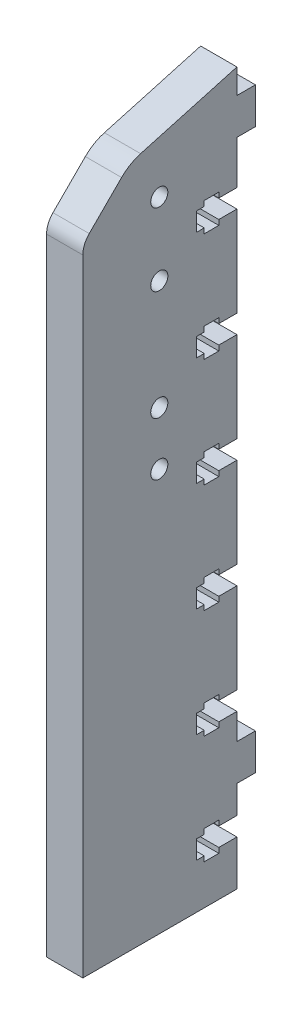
ISO-10303-21;
HEADER;
FILE_DESCRIPTION(('STEP AP214'),'2;1');
FILE_NAME('part.step','',(''),(''),'','','');
FILE_SCHEMA(('AUTOMOTIVE_DESIGN { 1 0 10303 214 1 1 1 1 }'));
ENDSEC;
DATA;
#1=APPLICATION_CONTEXT('core data for automotive mechanical design processes');
#2=APPLICATION_PROTOCOL_DEFINITION('international standard','automotive_design',2000,#1);
#3=PRODUCT_CONTEXT('',#1,'mechanical');
#4=PRODUCT('Part','Part','',(#3));
#5=PRODUCT_RELATED_PRODUCT_CATEGORY('part','',(#4));
#6=PRODUCT_DEFINITION_FORMATION('','',#4);
#7=PRODUCT_DEFINITION_CONTEXT('part definition',#1,'design');
#8=PRODUCT_DEFINITION('design','',#6,#7);
#9=PRODUCT_DEFINITION_SHAPE('','',#8);
#10=(LENGTH_UNIT() NAMED_UNIT(*) SI_UNIT(.MILLI.,.METRE.));
#11=(NAMED_UNIT(*) PLANE_ANGLE_UNIT() SI_UNIT($,.RADIAN.));
#12=(NAMED_UNIT(*) SI_UNIT($,.STERADIAN.) SOLID_ANGLE_UNIT());
#13=UNCERTAINTY_MEASURE_WITH_UNIT(LENGTH_MEASURE(1.E-05),#10,'distance_accuracy_value','');
#14=(GEOMETRIC_REPRESENTATION_CONTEXT(3) GLOBAL_UNCERTAINTY_ASSIGNED_CONTEXT((#13)) GLOBAL_UNIT_ASSIGNED_CONTEXT((#10,
#11,#12)) REPRESENTATION_CONTEXT('',''));
#15=CARTESIAN_POINT('',(0.,0.,0.));
#16=DIRECTION('',(0.,0.,1.));
#17=DIRECTION('',(1.,0.,0.));
#18=AXIS2_PLACEMENT_3D('',#15,#16,#17);
#19=CARTESIAN_POINT('',(0.,0.,0.));
#20=DIRECTION('',(0.,0.,1.));
#21=DIRECTION('',(1.,0.,0.));
#22=AXIS2_PLACEMENT_3D('',#19,#20,#21);
#23=PLANE('',#22);
#24=DIRECTION('',(0.,1.,0.));
#25=VECTOR('',#24,1.);
#26=CARTESIAN_POINT('',(0.,0.,0.));
#27=LINE('',#26,#25);
#28=CARTESIAN_POINT('',(0.,44.74,0.));
#29=VERTEX_POINT('',#28);
#30=CARTESIAN_POINT('',(0.,53.9,-1.33009500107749E-13));
#31=VERTEX_POINT('',#30);
#32=EDGE_CURVE('E594',#29,#31,#27,.T.);
#33=ORIENTED_EDGE('',*,*,#32,.F.);
#34=DIRECTION('',(-1.,0.,0.));
#35=VECTOR('',#34,1.);
#36=CARTESIAN_POINT('',(0.,44.74,0.));
#37=LINE('',#36,#35);
#38=CARTESIAN_POINT('',(-12.7,44.74,0.));
#39=VERTEX_POINT('',#38);
#40=EDGE_CURVE('E1604',#29,#39,#37,.T.);
#41=ORIENTED_EDGE('',*,*,#40,.T.);
#42=DIRECTION('',(0.,-1.,0.));
#43=VECTOR('',#42,1.);
#44=CARTESIAN_POINT('',(-12.7,0.,0.));
#45=LINE('',#44,#43);
#46=CARTESIAN_POINT('',(-12.7,53.9,0.));
#47=VERTEX_POINT('',#46);
#48=EDGE_CURVE('E617',#47,#39,#45,.T.);
#49=ORIENTED_EDGE('',*,*,#48,.F.);
#50=DIRECTION('',(-1.,0.,0.));
#51=VECTOR('',#50,1.);
#52=CARTESIAN_POINT('',(0.,53.9,-1.33009500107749E-13));
#53=LINE('',#52,#51);
#54=EDGE_CURVE('E1003',#31,#47,#53,.T.);
#55=ORIENTED_EDGE('',*,*,#54,.F.);
#56=EDGE_LOOP('',(#33,#41,#49,#55));
#57=FACE_BOUND('',#56,.T.);
#58=ADVANCED_FACE('F33',(#57),#23,.F.);
#59=CARTESIAN_POINT('',(-12.7,249.401461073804,-1.27502796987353E-13));
#60=VERTEX_POINT('',#59);
#61=CARTESIAN_POINT('',(-12.7,240.74,-2.55005593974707E-13));
#62=VERTEX_POINT('',#61);
#63=EDGE_CURVE('E583',#60,#62,#45,.T.);
#64=ORIENTED_EDGE('',*,*,#63,.F.);
#65=DIRECTION('',(-1.,0.,0.));
#66=VECTOR('',#65,1.);
#67=CARTESIAN_POINT('',(0.,249.401461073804,-1.27502796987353E-13));
#68=LINE('',#67,#66);
#69=CARTESIAN_POINT('',(0.,249.401461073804,-1.27502796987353E-13));
#70=VERTEX_POINT('',#69);
#71=EDGE_CURVE('E571',#70,#60,#68,.T.);
#72=ORIENTED_EDGE('',*,*,#71,.F.);
#73=CARTESIAN_POINT('',(0.,240.74,-2.55005593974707E-13));
#74=VERTEX_POINT('',#73);
#75=EDGE_CURVE('E582',#74,#70,#27,.T.);
#76=ORIENTED_EDGE('',*,*,#75,.F.);
#77=DIRECTION('',(-1.,0.,0.));
#78=VECTOR('',#77,1.);
#79=CARTESIAN_POINT('',(0.,240.74,-2.55005593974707E-13));
#80=LINE('',#79,#78);
#81=EDGE_CURVE('E1633',#74,#62,#80,.T.);
#82=ORIENTED_EDGE('',*,*,#81,.T.);
#83=EDGE_LOOP('',(#64,#72,#76,#82));
#84=FACE_BOUND('',#83,.T.);
#85=ADVANCED_FACE('F580',(#84),#23,.F.);
#86=CARTESIAN_POINT('',(-12.7,228.04,0.));
#87=VERTEX_POINT('',#86);
#88=CARTESIAN_POINT('',(-12.7,212.8,-6.66305286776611E-13));
#89=VERTEX_POINT('',#88);
#90=EDGE_CURVE('E622',#87,#89,#45,.T.);
#91=ORIENTED_EDGE('',*,*,#90,.F.);
#92=DIRECTION('',(-1.,0.,0.));
#93=VECTOR('',#92,1.);
#94=CARTESIAN_POINT('',(0.,228.04,-2.55005593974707E-13));
#95=LINE('',#94,#93);
#96=CARTESIAN_POINT('',(0.,228.04,-2.55005593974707E-13));
#97=VERTEX_POINT('',#96);
#98=EDGE_CURVE('E1635',#97,#87,#95,.T.);
#99=ORIENTED_EDGE('',*,*,#98,.F.);
#100=CARTESIAN_POINT('',(0.,212.8,-6.66305286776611E-13));
#101=VERTEX_POINT('',#100);
#102=EDGE_CURVE('E591',#101,#97,#27,.T.);
#103=ORIENTED_EDGE('',*,*,#102,.F.);
#104=DIRECTION('',(-1.,0.,0.));
#105=VECTOR('',#104,1.);
#106=CARTESIAN_POINT('',(0.,212.8,-6.66305286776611E-13));
#107=LINE('',#106,#105);
#108=EDGE_CURVE('E665',#101,#89,#107,.T.);
#109=ORIENTED_EDGE('',*,*,#108,.T.);
#110=EDGE_LOOP('',(#91,#99,#103,#109));
#111=FACE_BOUND('',#110,.T.);
#112=ADVANCED_FACE('F673',(#111),#23,.F.);
#113=CARTESIAN_POINT('',(-12.7,206.3,0.));
#114=VERTEX_POINT('',#113);
#115=CARTESIAN_POINT('',(-12.7,174.7,-5.33279847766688E-13));
#116=VERTEX_POINT('',#115);
#117=EDGE_CURVE('E640',#114,#116,#45,.T.);
#118=ORIENTED_EDGE('',*,*,#117,.F.);
#119=DIRECTION('',(-1.,0.,0.));
#120=VECTOR('',#119,1.);
#121=CARTESIAN_POINT('',(0.,206.3,-6.65111256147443E-13));
#122=LINE('',#121,#120);
#123=CARTESIAN_POINT('',(0.,206.3,-6.65111256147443E-13));
#124=VERTEX_POINT('',#123);
#125=EDGE_CURVE('E700',#124,#114,#122,.T.);
#126=ORIENTED_EDGE('',*,*,#125,.F.);
#127=CARTESIAN_POINT('',(0.,174.7,-5.33279847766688E-13));
#128=VERTEX_POINT('',#127);
#129=EDGE_CURVE('E596',#128,#124,#27,.T.);
#130=ORIENTED_EDGE('',*,*,#129,.F.);
#131=DIRECTION('',(-1.,0.,0.));
#132=VECTOR('',#131,1.);
#133=CARTESIAN_POINT('',(0.,174.7,-5.33279847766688E-13));
#134=LINE('',#133,#132);
#135=EDGE_CURVE('E765',#128,#116,#134,.T.);
#136=ORIENTED_EDGE('',*,*,#135,.T.);
#137=EDGE_LOOP('',(#118,#126,#130,#136));
#138=FACE_BOUND('',#137,.T.);
#139=ADVANCED_FACE('F1712',(#138),#23,.F.);
#140=CARTESIAN_POINT('',(-12.7,168.2,0.));
#141=VERTEX_POINT('',#140);
#142=CARTESIAN_POINT('',(-12.7,136.6,-4.00254408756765E-13));
#143=VERTEX_POINT('',#142);
#144=EDGE_CURVE('E635',#141,#143,#45,.T.);
#145=ORIENTED_EDGE('',*,*,#144,.F.);
#146=DIRECTION('',(-1.,0.,0.));
#147=VECTOR('',#146,1.);
#148=CARTESIAN_POINT('',(0.,168.2,-5.32085817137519E-13));
#149=LINE('',#148,#147);
#150=CARTESIAN_POINT('',(0.,168.2,-5.32085817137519E-13));
#151=VERTEX_POINT('',#150);
#152=EDGE_CURVE('E736',#151,#141,#149,.T.);
#153=ORIENTED_EDGE('',*,*,#152,.F.);
#154=CARTESIAN_POINT('',(0.,136.6,-4.00254408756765E-13));
#155=VERTEX_POINT('',#154);
#156=EDGE_CURVE('E1739',#155,#151,#27,.T.);
#157=ORIENTED_EDGE('',*,*,#156,.F.);
#158=DIRECTION('',(-1.,0.,0.));
#159=VECTOR('',#158,1.);
#160=CARTESIAN_POINT('',(0.,136.6,-4.00254408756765E-13));
#161=LINE('',#160,#159);
#162=EDGE_CURVE('E855',#155,#143,#161,.T.);
#163=ORIENTED_EDGE('',*,*,#162,.T.);
#164=EDGE_LOOP('',(#145,#153,#157,#163));
#165=FACE_BOUND('',#164,.T.);
#166=ADVANCED_FACE('F1736',(#165),#23,.F.);
#167=CARTESIAN_POINT('',(-12.7,130.1,0.));
#168=VERTEX_POINT('',#167);
#169=CARTESIAN_POINT('',(-12.7,98.5,-2.67228969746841E-13));
#170=VERTEX_POINT('',#169);
#171=EDGE_CURVE('E630',#168,#170,#45,.T.);
#172=ORIENTED_EDGE('',*,*,#171,.F.);
#173=DIRECTION('',(-1.,0.,0.));
#174=VECTOR('',#173,1.);
#175=CARTESIAN_POINT('',(0.,130.1,-3.99060378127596E-13));
#176=LINE('',#175,#174);
#177=CARTESIAN_POINT('',(0.,130.1,-3.99060378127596E-13));
#178=VERTEX_POINT('',#177);
#179=EDGE_CURVE('E824',#178,#168,#176,.T.);
#180=ORIENTED_EDGE('',*,*,#179,.F.);
#181=CARTESIAN_POINT('',(0.,98.5,-2.67228969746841E-13));
#182=VERTEX_POINT('',#181);
#183=EDGE_CURVE('E610',#182,#178,#27,.T.);
#184=ORIENTED_EDGE('',*,*,#183,.F.);
#185=DIRECTION('',(-1.,0.,0.));
#186=VECTOR('',#185,1.);
#187=CARTESIAN_POINT('',(0.,98.5,-2.67228969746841E-13));
#188=LINE('',#187,#186);
#189=EDGE_CURVE('E945',#182,#170,#188,.T.);
#190=ORIENTED_EDGE('',*,*,#189,.T.);
#191=EDGE_LOOP('',(#172,#180,#184,#190));
#192=FACE_BOUND('',#191,.T.);
#193=ADVANCED_FACE('F1250',(#192),#23,.F.);
#194=CARTESIAN_POINT('',(-12.7,92.,0.));
#195=VERTEX_POINT('',#194);
#196=CARTESIAN_POINT('',(-12.7,60.4,-1.34203530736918E-13));
#197=VERTEX_POINT('',#196);
#198=EDGE_CURVE('E626',#195,#197,#45,.T.);
#199=ORIENTED_EDGE('',*,*,#198,.F.);
#200=DIRECTION('',(-1.,0.,0.));
#201=VECTOR('',#200,1.);
#202=CARTESIAN_POINT('',(0.,92.,-2.66034939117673E-13));
#203=LINE('',#202,#201);
#204=CARTESIAN_POINT('',(0.,92.,-2.66034939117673E-13));
#205=VERTEX_POINT('',#204);
#206=EDGE_CURVE('E914',#205,#195,#203,.T.);
#207=ORIENTED_EDGE('',*,*,#206,.F.);
#208=CARTESIAN_POINT('',(0.,60.4,-1.34203530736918E-13));
#209=VERTEX_POINT('',#208);
#210=EDGE_CURVE('E603',#209,#205,#27,.T.);
#211=ORIENTED_EDGE('',*,*,#210,.F.);
#212=DIRECTION('',(-1.,0.,0.));
#213=VECTOR('',#212,1.);
#214=CARTESIAN_POINT('',(0.,60.4,-1.34203530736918E-13));
#215=LINE('',#214,#213);
#216=EDGE_CURVE('E1034',#209,#197,#215,.T.);
#217=ORIENTED_EDGE('',*,*,#216,.T.);
#218=EDGE_LOOP('',(#199,#207,#211,#217));
#219=FACE_BOUND('',#218,.T.);
#220=ADVANCED_FACE('F1242',(#219),#23,.F.);
#221=CARTESIAN_POINT('',(-12.7,32.04,0.));
#222=VERTEX_POINT('',#221);
#223=CARTESIAN_POINT('',(-12.7,22.3,0.));
#224=VERTEX_POINT('',#223);
#225=EDGE_CURVE('E616',#222,#224,#45,.T.);
#226=ORIENTED_EDGE('',*,*,#225,.F.);
#227=DIRECTION('',(-1.,0.,0.));
#228=VECTOR('',#227,1.);
#229=CARTESIAN_POINT('',(0.,32.04,0.));
#230=LINE('',#229,#228);
#231=CARTESIAN_POINT('',(0.,32.04,0.));
#232=VERTEX_POINT('',#231);
#233=EDGE_CURVE('E1256',#232,#222,#230,.T.);
#234=ORIENTED_EDGE('',*,*,#233,.F.);
#235=CARTESIAN_POINT('',(0.,22.3,0.));
#236=VERTEX_POINT('',#235);
#237=EDGE_CURVE('E602',#236,#232,#27,.T.);
#238=ORIENTED_EDGE('',*,*,#237,.F.);
#239=DIRECTION('',(-1.,0.,0.));
#240=VECTOR('',#239,1.);
#241=CARTESIAN_POINT('',(0.,22.3,0.));
#242=LINE('',#241,#240);
#243=EDGE_CURVE('E1124',#236,#224,#242,.T.);
#244=ORIENTED_EDGE('',*,*,#243,.T.);
#245=EDGE_LOOP('',(#226,#234,#238,#244));
#246=FACE_BOUND('',#245,.T.);
#247=ADVANCED_FACE('F1232',(#246),#23,.F.);
#248=CARTESIAN_POINT('',(0.,0.,53.975));
#249=DIRECTION('',(-1.,0.,0.));
#250=DIRECTION('',(0.,0.,1.));
#251=AXIS2_PLACEMENT_3D('',#248,#249,#250);
#252=PLANE('',#251);
#253=CARTESIAN_POINT('',(0.,140.968609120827,27.1953617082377));
#254=DIRECTION('',(-1.,0.,0.));
#255=DIRECTION('',(0.,0.,1.));
#256=AXIS2_PLACEMENT_3D('',#253,#254,#255);
#257=CIRCLE('',#256,3.);
#258=CARTESIAN_POINT('',(0.,140.968609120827,30.1953617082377));
#259=VERTEX_POINT('',#258);
#260=EDGE_CURVE('E1149',#259,#259,#257,.T.);
#261=ORIENTED_EDGE('',*,*,#260,.T.);
#262=EDGE_LOOP('',(#261));
#263=FACE_BOUND('',#262,.T.);
#264=CARTESIAN_POINT('',(0.,159.637609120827,27.1953617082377));
#265=DIRECTION('',(-1.,0.,0.));
#266=DIRECTION('',(0.,0.,1.));
#267=AXIS2_PLACEMENT_3D('',#264,#265,#266);
#268=CIRCLE('',#267,3.);
#269=CARTESIAN_POINT('',(0.,159.637609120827,30.1953617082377));
#270=VERTEX_POINT('',#269);
#271=EDGE_CURVE('E1155',#270,#270,#268,.T.);
#272=ORIENTED_EDGE('',*,*,#271,.T.);
#273=EDGE_LOOP('',(#272));
#274=FACE_BOUND('',#273,.T.);
#275=CARTESIAN_POINT('',(0.,198.118609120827,27.1953617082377));
#276=DIRECTION('',(-1.,0.,0.));
#277=DIRECTION('',(0.,0.,1.));
#278=AXIS2_PLACEMENT_3D('',#275,#276,#277);
#279=CIRCLE('',#278,3.);
#280=CARTESIAN_POINT('',(0.,198.118609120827,30.1953617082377));
#281=VERTEX_POINT('',#280);
#282=EDGE_CURVE('E1161',#281,#281,#279,.T.);
#283=ORIENTED_EDGE('',*,*,#282,.T.);
#284=EDGE_LOOP('',(#283));
#285=FACE_BOUND('',#284,.T.);
#286=CARTESIAN_POINT('',(0.,223.518609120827,27.1953617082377));
#287=DIRECTION('',(-1.,0.,0.));
#288=DIRECTION('',(0.,0.,1.));
#289=AXIS2_PLACEMENT_3D('',#286,#287,#288);
#290=CIRCLE('',#289,3.);
#291=CARTESIAN_POINT('',(0.,223.518609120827,30.1953617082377));
#292=VERTEX_POINT('',#291);
#293=EDGE_CURVE('E1167',#292,#292,#290,.T.);
#294=ORIENTED_EDGE('',*,*,#293,.T.);
#295=EDGE_LOOP('',(#294));
#296=FACE_BOUND('',#295,.T.);
#297=DIRECTION('',(0.,-0.269564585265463,0.962982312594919));
#298=VECTOR('',#297,1.);
#299=CARTESIAN_POINT('',(0.,249.401461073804,-1.27502796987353E-13));
#300=LINE('',#299,#298);
#301=CARTESIAN_POINT('',(0.,239.959101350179,33.7315281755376));
#302=VERTEX_POINT('',#301);
#303=EDGE_CURVE('E568',#70,#302,#300,.T.);
#304=ORIENTED_EDGE('',*,*,#303,.T.);
#305=CARTESIAN_POINT('',(0.,225.283250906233,29.623363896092));
#306=DIRECTION('',(-1.,0.,0.));
#307=DIRECTION('',(0.,0.,1.));
#308=AXIS2_PLACEMENT_3D('',#305,#306,#307);
#309=CIRCLE('',#308,15.24);
#310=CARTESIAN_POINT('',(0.,236.059558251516,40.3996712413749));
#311=VERTEX_POINT('',#310);
#312=EDGE_CURVE('E11',#302,#311,#309,.F.);
#313=ORIENTED_EDGE('',*,*,#312,.T.);
#314=DIRECTION('',(0.,0.707106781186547,-0.707106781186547));
#315=VECTOR('',#314,1.);
#316=CARTESIAN_POINT('',(0.,276.459229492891,0.));
#317=LINE('',#316,#315);
#318=CARTESIAN_POINT('',(0.,224.716075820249,51.7431536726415));
#319=VERTEX_POINT('',#318);
#320=EDGE_CURVE('E597',#319,#311,#317,.T.);
#321=ORIENTED_EDGE('',*,*,#320,.F.);
#322=CARTESIAN_POINT('',(0.,219.327922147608,46.355));
#323=DIRECTION('',(-1.,0.,0.));
#324=DIRECTION('',(0.,0.,1.));
#325=AXIS2_PLACEMENT_3D('',#322,#323,#324);
#326=CIRCLE('',#325,7.62);
#327=CARTESIAN_POINT('',(0.,219.327922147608,53.975));
#328=VERTEX_POINT('',#327);
#329=EDGE_CURVE('E1191',#319,#328,#326,.F.);
#330=ORIENTED_EDGE('',*,*,#329,.T.);
#331=DIRECTION('',(0.,1.,0.));
#332=VECTOR('',#331,1.);
#333=CARTESIAN_POINT('',(0.,0.,53.975));
#334=LINE('',#333,#332);
#335=CARTESIAN_POINT('',(0.,0.,53.975));
#336=VERTEX_POINT('',#335);
#337=EDGE_CURVE('E1174',#336,#328,#334,.T.);
#338=ORIENTED_EDGE('',*,*,#337,.F.);
#339=DIRECTION('',(0.,0.,-1.));
#340=VECTOR('',#339,1.);
#341=CARTESIAN_POINT('',(0.,0.,53.975));
#342=LINE('',#341,#340);
#343=CARTESIAN_POINT('',(0.,0.,0.));
#344=VERTEX_POINT('',#343);
#345=EDGE_CURVE('E1179',#336,#344,#342,.T.);
#346=ORIENTED_EDGE('',*,*,#345,.T.);
#347=CARTESIAN_POINT('',(0.,15.8,0.));
#348=VERTEX_POINT('',#347);
#349=EDGE_CURVE('E599',#344,#348,#27,.T.);
#350=ORIENTED_EDGE('',*,*,#349,.T.);
#351=DIRECTION('',(0.,0.,1.));
#352=VECTOR('',#351,1.);
#353=CARTESIAN_POINT('',(0.,15.8,0.));
#354=LINE('',#353,#352);
#355=CARTESIAN_POINT('',(0.,15.8,6.34999999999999));
#356=VERTEX_POINT('',#355);
#357=EDGE_CURVE('E1059',#348,#356,#354,.T.);
#358=ORIENTED_EDGE('',*,*,#357,.T.);
#359=DIRECTION('',(0.,-1.,0.));
#360=VECTOR('',#359,1.);
#361=CARTESIAN_POINT('',(0.,15.8,6.34999999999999));
#362=LINE('',#361,#360);
#363=CARTESIAN_POINT('',(0.,14.,6.34999999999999));
#364=VERTEX_POINT('',#363);
#365=EDGE_CURVE('E1061',#356,#364,#362,.T.);
#366=ORIENTED_EDGE('',*,*,#365,.T.);
#367=DIRECTION('',(0.,0.,1.));
#368=VECTOR('',#367,1.);
#369=CARTESIAN_POINT('',(0.,14.,6.34999999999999));
#370=LINE('',#369,#368);
#371=CARTESIAN_POINT('',(0.,14.,11.45));
#372=VERTEX_POINT('',#371);
#373=EDGE_CURVE('E1065',#364,#372,#370,.T.);
#374=ORIENTED_EDGE('',*,*,#373,.T.);
#375=DIRECTION('',(0.,1.,0.));
#376=VECTOR('',#375,1.);
#377=CARTESIAN_POINT('',(0.,14.,11.45));
#378=LINE('',#377,#376);
#379=CARTESIAN_POINT('',(0.,15.8,11.45));
#380=VERTEX_POINT('',#379);
#381=EDGE_CURVE('E1068',#372,#380,#378,.T.);
#382=ORIENTED_EDGE('',*,*,#381,.T.);
#383=DIRECTION('',(0.,0.,1.));
#384=VECTOR('',#383,1.);
#385=CARTESIAN_POINT('',(0.,15.8,11.45));
#386=LINE('',#385,#384);
#387=CARTESIAN_POINT('',(0.,15.8,14.224));
#388=VERTEX_POINT('',#387);
#389=EDGE_CURVE('E1071',#380,#388,#386,.T.);
#390=ORIENTED_EDGE('',*,*,#389,.T.);
#391=DIRECTION('',(0.,1.,0.));
#392=VECTOR('',#391,1.);
#393=CARTESIAN_POINT('',(0.,15.8,14.224));
#394=LINE('',#393,#392);
#395=CARTESIAN_POINT('',(0.,22.3,14.224));
#396=VERTEX_POINT('',#395);
#397=EDGE_CURVE('E1074',#388,#396,#394,.T.);
#398=ORIENTED_EDGE('',*,*,#397,.T.);
#399=DIRECTION('',(0.,0.,-1.));
#400=VECTOR('',#399,1.);
#401=CARTESIAN_POINT('',(0.,22.3,11.45));
#402=LINE('',#401,#400);
#403=CARTESIAN_POINT('',(0.,22.3,11.45));
#404=VERTEX_POINT('',#403);
#405=EDGE_CURVE('E1077',#396,#404,#402,.T.);
#406=ORIENTED_EDGE('',*,*,#405,.T.);
#407=DIRECTION('',(0.,1.,0.));
#408=VECTOR('',#407,1.);
#409=CARTESIAN_POINT('',(0.,24.1,11.45));
#410=LINE('',#409,#408);
#411=CARTESIAN_POINT('',(0.,24.1,11.45));
#412=VERTEX_POINT('',#411);
#413=EDGE_CURVE('E1080',#404,#412,#410,.T.);
#414=ORIENTED_EDGE('',*,*,#413,.T.);
#415=DIRECTION('',(0.,0.,-1.));
#416=VECTOR('',#415,1.);
#417=CARTESIAN_POINT('',(0.,24.1,6.34999999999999));
#418=LINE('',#417,#416);
#419=CARTESIAN_POINT('',(0.,24.1,6.34999999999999));
#420=VERTEX_POINT('',#419);
#421=EDGE_CURVE('E1083',#412,#420,#418,.T.);
#422=ORIENTED_EDGE('',*,*,#421,.T.);
#423=DIRECTION('',(0.,-1.,0.));
#424=VECTOR('',#423,1.);
#425=CARTESIAN_POINT('',(0.,22.3,6.34999999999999));
#426=LINE('',#425,#424);
#427=CARTESIAN_POINT('',(0.,22.3,6.34999999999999));
#428=VERTEX_POINT('',#427);
#429=EDGE_CURVE('E1086',#420,#428,#426,.T.);
#430=ORIENTED_EDGE('',*,*,#429,.T.);
#431=DIRECTION('',(0.,0.,-1.));
#432=VECTOR('',#431,1.);
#433=CARTESIAN_POINT('',(0.,22.3,0.));
#434=LINE('',#433,#432);
#435=EDGE_CURVE('E1089',#428,#236,#434,.T.);
#436=ORIENTED_EDGE('',*,*,#435,.T.);
#437=ORIENTED_EDGE('',*,*,#237,.T.);
#438=DIRECTION('',(0.,0.,1.));
#439=VECTOR('',#438,1.);
#440=CARTESIAN_POINT('',(0.,32.04,-6.47700000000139));
#441=LINE('',#440,#439);
#442=CARTESIAN_POINT('',(0.,32.04,-6.47700000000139));
#443=VERTEX_POINT('',#442);
#444=EDGE_CURVE('E2362',#443,#232,#441,.T.);
#445=ORIENTED_EDGE('',*,*,#444,.F.);
#446=DIRECTION('',(0.,-1.,0.));
#447=VECTOR('',#446,1.);
#448=CARTESIAN_POINT('',(0.,32.04,-6.47700000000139));
#449=LINE('',#448,#447);
#450=CARTESIAN_POINT('',(0.,44.74,-6.47700000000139));
#451=VERTEX_POINT('',#450);
#452=EDGE_CURVE('E1607',#451,#443,#449,.T.);
#453=ORIENTED_EDGE('',*,*,#452,.F.);
#454=DIRECTION('',(0.,0.,-1.));
#455=VECTOR('',#454,1.);
#456=CARTESIAN_POINT('',(0.,44.74,-6.47700000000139));
#457=LINE('',#456,#455);
#458=EDGE_CURVE('E1617',#29,#451,#457,.T.);
#459=ORIENTED_EDGE('',*,*,#458,.F.);
#460=ORIENTED_EDGE('',*,*,#32,.T.);
#461=DIRECTION('',(0.,0.,1.));
#462=VECTOR('',#461,1.);
#463=CARTESIAN_POINT('',(0.,53.9,-1.33009500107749E-13));
#464=LINE('',#463,#462);
#465=CARTESIAN_POINT('',(0.,53.9,6.34999999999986));
#466=VERTEX_POINT('',#465);
#467=EDGE_CURVE('E970',#31,#466,#464,.T.);
#468=ORIENTED_EDGE('',*,*,#467,.T.);
#469=DIRECTION('',(0.,-1.,0.));
#470=VECTOR('',#469,1.);
#471=CARTESIAN_POINT('',(0.,53.9,6.34999999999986));
#472=LINE('',#471,#470);
#473=CARTESIAN_POINT('',(0.,52.1,6.34999999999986));
#474=VERTEX_POINT('',#473);
#475=EDGE_CURVE('E972',#466,#474,#472,.T.);
#476=ORIENTED_EDGE('',*,*,#475,.T.);
#477=DIRECTION('',(0.,0.,1.));
#478=VECTOR('',#477,1.);
#479=CARTESIAN_POINT('',(0.,52.1,6.34999999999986));
#480=LINE('',#479,#478);
#481=CARTESIAN_POINT('',(0.,52.1,11.4499999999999));
#482=VERTEX_POINT('',#481);
#483=EDGE_CURVE('E976',#474,#482,#480,.T.);
#484=ORIENTED_EDGE('',*,*,#483,.T.);
#485=DIRECTION('',(0.,1.,0.));
#486=VECTOR('',#485,1.);
#487=CARTESIAN_POINT('',(0.,52.1,11.4499999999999));
#488=LINE('',#487,#486);
#489=CARTESIAN_POINT('',(0.,53.9,11.4499999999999));
#490=VERTEX_POINT('',#489);
#491=EDGE_CURVE('E979',#482,#490,#488,.T.);
#492=ORIENTED_EDGE('',*,*,#491,.T.);
#493=DIRECTION('',(0.,0.,1.));
#494=VECTOR('',#493,1.);
#495=CARTESIAN_POINT('',(0.,53.9,11.4499999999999));
#496=LINE('',#495,#494);
#497=CARTESIAN_POINT('',(0.,53.9,14.2239999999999));
#498=VERTEX_POINT('',#497);
#499=EDGE_CURVE('E982',#490,#498,#496,.T.);
#500=ORIENTED_EDGE('',*,*,#499,.T.);
#501=DIRECTION('',(0.,1.,0.));
#502=VECTOR('',#501,1.);
#503=CARTESIAN_POINT('',(0.,53.9,14.2239999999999));
#504=LINE('',#503,#502);
#505=CARTESIAN_POINT('',(0.,60.4,14.2239999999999));
#506=VERTEX_POINT('',#505);
#507=EDGE_CURVE('E985',#498,#506,#504,.T.);
#508=ORIENTED_EDGE('',*,*,#507,.T.);
#509=DIRECTION('',(0.,0.,-1.));
#510=VECTOR('',#509,1.);
#511=CARTESIAN_POINT('',(0.,60.4,11.4499999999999));
#512=LINE('',#511,#510);
#513=CARTESIAN_POINT('',(0.,60.4,11.4499999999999));
#514=VERTEX_POINT('',#513);
#515=EDGE_CURVE('E988',#506,#514,#512,.T.);
#516=ORIENTED_EDGE('',*,*,#515,.T.);
#517=DIRECTION('',(0.,1.,0.));
#518=VECTOR('',#517,1.);
#519=CARTESIAN_POINT('',(0.,62.2,11.4499999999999));
#520=LINE('',#519,#518);
#521=CARTESIAN_POINT('',(0.,62.2,11.4499999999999));
#522=VERTEX_POINT('',#521);
#523=EDGE_CURVE('E991',#514,#522,#520,.T.);
#524=ORIENTED_EDGE('',*,*,#523,.T.);
#525=DIRECTION('',(0.,0.,-1.));
#526=VECTOR('',#525,1.);
#527=CARTESIAN_POINT('',(0.,62.2,6.34999999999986));
#528=LINE('',#527,#526);
#529=CARTESIAN_POINT('',(0.,62.2,6.34999999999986));
#530=VERTEX_POINT('',#529);
#531=EDGE_CURVE('E994',#522,#530,#528,.T.);
#532=ORIENTED_EDGE('',*,*,#531,.T.);
#533=DIRECTION('',(0.,-1.,0.));
#534=VECTOR('',#533,1.);
#535=CARTESIAN_POINT('',(0.,60.4,6.34999999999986));
#536=LINE('',#535,#534);
#537=CARTESIAN_POINT('',(0.,60.4,6.34999999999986));
#538=VERTEX_POINT('',#537);
#539=EDGE_CURVE('E997',#530,#538,#536,.T.);
#540=ORIENTED_EDGE('',*,*,#539,.T.);
#541=DIRECTION('',(0.,0.,-1.));
#542=VECTOR('',#541,1.);
#543=CARTESIAN_POINT('',(0.,60.4,-1.34203530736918E-13));
#544=LINE('',#543,#542);
#545=EDGE_CURVE('E1000',#538,#209,#544,.T.);
#546=ORIENTED_EDGE('',*,*,#545,.T.);
#547=ORIENTED_EDGE('',*,*,#210,.T.);
#548=DIRECTION('',(0.,0.,1.));
#549=VECTOR('',#548,1.);
#550=CARTESIAN_POINT('',(0.,92.,-2.66034939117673E-13));
#551=LINE('',#550,#549);
#552=CARTESIAN_POINT('',(0.,92.,6.34999999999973));
#553=VERTEX_POINT('',#552);
#554=EDGE_CURVE('E880',#205,#553,#551,.T.);
#555=ORIENTED_EDGE('',*,*,#554,.T.);
#556=DIRECTION('',(0.,-1.,0.));
#557=VECTOR('',#556,1.);
#558=CARTESIAN_POINT('',(0.,92.,6.34999999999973));
#559=LINE('',#558,#557);
#560=CARTESIAN_POINT('',(0.,90.2,6.34999999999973));
#561=VERTEX_POINT('',#560);
#562=EDGE_CURVE('E883',#553,#561,#559,.T.);
#563=ORIENTED_EDGE('',*,*,#562,.T.);
#564=DIRECTION('',(0.,0.,1.));
#565=VECTOR('',#564,1.);
#566=CARTESIAN_POINT('',(0.,90.2,6.34999999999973));
#567=LINE('',#566,#565);
#568=CARTESIAN_POINT('',(0.,90.2,11.4499999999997));
#569=VERTEX_POINT('',#568);
#570=EDGE_CURVE('E887',#561,#569,#567,.T.);
#571=ORIENTED_EDGE('',*,*,#570,.T.);
#572=DIRECTION('',(0.,1.,0.));
#573=VECTOR('',#572,1.);
#574=CARTESIAN_POINT('',(0.,90.2,11.4499999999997));
#575=LINE('',#574,#573);
#576=CARTESIAN_POINT('',(0.,92.,11.4499999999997));
#577=VERTEX_POINT('',#576);
#578=EDGE_CURVE('E890',#569,#577,#575,.T.);
#579=ORIENTED_EDGE('',*,*,#578,.T.);
#580=DIRECTION('',(0.,0.,1.));
#581=VECTOR('',#580,1.);
#582=CARTESIAN_POINT('',(0.,92.,11.4499999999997));
#583=LINE('',#582,#581);
#584=CARTESIAN_POINT('',(0.,92.,14.2239999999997));
#585=VERTEX_POINT('',#584);
#586=EDGE_CURVE('E893',#577,#585,#583,.T.);
#587=ORIENTED_EDGE('',*,*,#586,.T.);
#588=DIRECTION('',(0.,1.,0.));
#589=VECTOR('',#588,1.);
#590=CARTESIAN_POINT('',(0.,92.,14.2239999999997));
#591=LINE('',#590,#589);
#592=CARTESIAN_POINT('',(0.,98.5,14.2239999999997));
#593=VERTEX_POINT('',#592);
#594=EDGE_CURVE('E896',#585,#593,#591,.T.);
#595=ORIENTED_EDGE('',*,*,#594,.T.);
#596=DIRECTION('',(0.,0.,-1.));
#597=VECTOR('',#596,1.);
#598=CARTESIAN_POINT('',(0.,98.5,11.4499999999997));
#599=LINE('',#598,#597);
#600=CARTESIAN_POINT('',(0.,98.5,11.4499999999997));
#601=VERTEX_POINT('',#600);
#602=EDGE_CURVE('E899',#593,#601,#599,.T.);
#603=ORIENTED_EDGE('',*,*,#602,.T.);
#604=DIRECTION('',(0.,1.,0.));
#605=VECTOR('',#604,1.);
#606=CARTESIAN_POINT('',(0.,100.3,11.4499999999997));
#607=LINE('',#606,#605);
#608=CARTESIAN_POINT('',(0.,100.3,11.4499999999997));
#609=VERTEX_POINT('',#608);
#610=EDGE_CURVE('E902',#601,#609,#607,.T.);
#611=ORIENTED_EDGE('',*,*,#610,.T.);
#612=DIRECTION('',(0.,0.,-1.));
#613=VECTOR('',#612,1.);
#614=CARTESIAN_POINT('',(0.,100.3,6.34999999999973));
#615=LINE('',#614,#613);
#616=CARTESIAN_POINT('',(0.,100.3,6.34999999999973));
#617=VERTEX_POINT('',#616);
#618=EDGE_CURVE('E905',#609,#617,#615,.T.);
#619=ORIENTED_EDGE('',*,*,#618,.T.);
#620=DIRECTION('',(0.,-1.,0.));
#621=VECTOR('',#620,1.);
#622=CARTESIAN_POINT('',(0.,98.5,6.34999999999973));
#623=LINE('',#622,#621);
#624=CARTESIAN_POINT('',(0.,98.5,6.34999999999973));
#625=VERTEX_POINT('',#624);
#626=EDGE_CURVE('E908',#617,#625,#623,.T.);
#627=ORIENTED_EDGE('',*,*,#626,.T.);
#628=DIRECTION('',(0.,0.,-1.));
#629=VECTOR('',#628,1.);
#630=CARTESIAN_POINT('',(0.,98.5,-2.67228969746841E-13));
#631=LINE('',#630,#629);
#632=EDGE_CURVE('E911',#625,#182,#631,.T.);
#633=ORIENTED_EDGE('',*,*,#632,.T.);
#634=ORIENTED_EDGE('',*,*,#183,.T.);
#635=DIRECTION('',(0.,0.,1.));
#636=VECTOR('',#635,1.);
#637=CARTESIAN_POINT('',(0.,130.1,-3.99060378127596E-13));
#638=LINE('',#637,#636);
#639=CARTESIAN_POINT('',(0.,130.1,6.3499999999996));
#640=VERTEX_POINT('',#639);
#641=EDGE_CURVE('E790',#178,#640,#638,.T.);
#642=ORIENTED_EDGE('',*,*,#641,.T.);
#643=DIRECTION('',(0.,-1.,0.));
#644=VECTOR('',#643,1.);
#645=CARTESIAN_POINT('',(0.,130.1,6.3499999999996));
#646=LINE('',#645,#644);
#647=CARTESIAN_POINT('',(0.,128.3,6.34999999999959));
#648=VERTEX_POINT('',#647);
#649=EDGE_CURVE('E793',#640,#648,#646,.T.);
#650=ORIENTED_EDGE('',*,*,#649,.T.);
#651=DIRECTION('',(0.,0.,1.));
#652=VECTOR('',#651,1.);
#653=CARTESIAN_POINT('',(0.,128.3,6.34999999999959));
#654=LINE('',#653,#652);
#655=CARTESIAN_POINT('',(0.,128.3,11.4499999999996));
#656=VERTEX_POINT('',#655);
#657=EDGE_CURVE('E797',#648,#656,#654,.T.);
#658=ORIENTED_EDGE('',*,*,#657,.T.);
#659=DIRECTION('',(0.,1.,0.));
#660=VECTOR('',#659,1.);
#661=CARTESIAN_POINT('',(0.,128.3,11.4499999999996));
#662=LINE('',#661,#660);
#663=CARTESIAN_POINT('',(0.,130.1,11.4499999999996));
#664=VERTEX_POINT('',#663);
#665=EDGE_CURVE('E800',#656,#664,#662,.T.);
#666=ORIENTED_EDGE('',*,*,#665,.T.);
#667=DIRECTION('',(0.,0.,1.));
#668=VECTOR('',#667,1.);
#669=CARTESIAN_POINT('',(0.,130.1,11.4499999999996));
#670=LINE('',#669,#668);
#671=CARTESIAN_POINT('',(0.,130.1,14.2239999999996));
#672=VERTEX_POINT('',#671);
#673=EDGE_CURVE('E803',#664,#672,#670,.T.);
#674=ORIENTED_EDGE('',*,*,#673,.T.);
#675=DIRECTION('',(0.,1.,0.));
#676=VECTOR('',#675,1.);
#677=CARTESIAN_POINT('',(0.,130.1,14.2239999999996));
#678=LINE('',#677,#676);
#679=CARTESIAN_POINT('',(0.,136.6,14.2239999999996));
#680=VERTEX_POINT('',#679);
#681=EDGE_CURVE('E806',#672,#680,#678,.T.);
#682=ORIENTED_EDGE('',*,*,#681,.T.);
#683=DIRECTION('',(0.,0.,-1.));
#684=VECTOR('',#683,1.);
#685=CARTESIAN_POINT('',(0.,136.6,11.4499999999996));
#686=LINE('',#685,#684);
#687=CARTESIAN_POINT('',(0.,136.6,11.4499999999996));
#688=VERTEX_POINT('',#687);
#689=EDGE_CURVE('E809',#680,#688,#686,.T.);
#690=ORIENTED_EDGE('',*,*,#689,.T.);
#691=DIRECTION('',(0.,1.,0.));
#692=VECTOR('',#691,1.);
#693=CARTESIAN_POINT('',(0.,138.4,11.4499999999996));
#694=LINE('',#693,#692);
#695=CARTESIAN_POINT('',(0.,138.4,11.4499999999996));
#696=VERTEX_POINT('',#695);
#697=EDGE_CURVE('E812',#688,#696,#694,.T.);
#698=ORIENTED_EDGE('',*,*,#697,.T.);
#699=DIRECTION('',(0.,0.,-1.));
#700=VECTOR('',#699,1.);
#701=CARTESIAN_POINT('',(0.,138.4,6.34999999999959));
#702=LINE('',#701,#700);
#703=CARTESIAN_POINT('',(0.,138.4,6.34999999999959));
#704=VERTEX_POINT('',#703);
#705=EDGE_CURVE('E815',#696,#704,#702,.T.);
#706=ORIENTED_EDGE('',*,*,#705,.T.);
#707=DIRECTION('',(0.,-1.,0.));
#708=VECTOR('',#707,1.);
#709=CARTESIAN_POINT('',(0.,136.6,6.34999999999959));
#710=LINE('',#709,#708);
#711=CARTESIAN_POINT('',(0.,136.6,6.34999999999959));
#712=VERTEX_POINT('',#711);
#713=EDGE_CURVE('E818',#704,#712,#710,.T.);
#714=ORIENTED_EDGE('',*,*,#713,.T.);
#715=DIRECTION('',(0.,0.,-1.));
#716=VECTOR('',#715,1.);
#717=CARTESIAN_POINT('',(0.,136.6,-4.00254408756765E-13));
#718=LINE('',#717,#716);
#719=EDGE_CURVE('E821',#712,#155,#718,.T.);
#720=ORIENTED_EDGE('',*,*,#719,.T.);
#721=ORIENTED_EDGE('',*,*,#156,.T.);
#722=DIRECTION('',(0.,0.,1.));
#723=VECTOR('',#722,1.);
#724=CARTESIAN_POINT('',(0.,168.2,-5.32085817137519E-13));
#725=LINE('',#724,#723);
#726=CARTESIAN_POINT('',(0.,168.2,6.34999999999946));
#727=VERTEX_POINT('',#726);
#728=EDGE_CURVE('E703',#151,#727,#725,.T.);
#729=ORIENTED_EDGE('',*,*,#728,.T.);
#730=DIRECTION('',(0.,-1.,0.));
#731=VECTOR('',#730,1.);
#732=CARTESIAN_POINT('',(0.,168.2,6.34999999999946));
#733=LINE('',#732,#731);
#734=CARTESIAN_POINT('',(0.,166.4,6.34999999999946));
#735=VERTEX_POINT('',#734);
#736=EDGE_CURVE('E706',#727,#735,#733,.T.);
#737=ORIENTED_EDGE('',*,*,#736,.T.);
#738=DIRECTION('',(0.,0.,1.));
#739=VECTOR('',#738,1.);
#740=CARTESIAN_POINT('',(0.,166.4,6.34999999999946));
#741=LINE('',#740,#739);
#742=CARTESIAN_POINT('',(0.,166.4,11.4499999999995));
#743=VERTEX_POINT('',#742);
#744=EDGE_CURVE('E710',#735,#743,#741,.T.);
#745=ORIENTED_EDGE('',*,*,#744,.T.);
#746=DIRECTION('',(0.,1.,0.));
#747=VECTOR('',#746,1.);
#748=CARTESIAN_POINT('',(0.,166.4,11.4499999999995));
#749=LINE('',#748,#747);
#750=CARTESIAN_POINT('',(0.,168.2,11.4499999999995));
#751=VERTEX_POINT('',#750);
#752=EDGE_CURVE('E713',#743,#751,#749,.T.);
#753=ORIENTED_EDGE('',*,*,#752,.T.);
#754=DIRECTION('',(0.,0.,1.));
#755=VECTOR('',#754,1.);
#756=CARTESIAN_POINT('',(0.,168.2,11.4499999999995));
#757=LINE('',#756,#755);
#758=CARTESIAN_POINT('',(0.,168.2,14.2239999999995));
#759=VERTEX_POINT('',#758);
#760=EDGE_CURVE('E716',#751,#759,#757,.T.);
#761=ORIENTED_EDGE('',*,*,#760,.T.);
#762=DIRECTION('',(0.,1.,0.));
#763=VECTOR('',#762,1.);
#764=CARTESIAN_POINT('',(0.,168.2,14.2239999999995));
#765=LINE('',#764,#763);
#766=CARTESIAN_POINT('',(0.,174.7,14.2239999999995));
#767=VERTEX_POINT('',#766);
#768=EDGE_CURVE('E719',#759,#767,#765,.T.);
#769=ORIENTED_EDGE('',*,*,#768,.T.);
#770=DIRECTION('',(0.,0.,-1.));
#771=VECTOR('',#770,1.);
#772=CARTESIAN_POINT('',(0.,174.7,11.4499999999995));
#773=LINE('',#772,#771);
#774=CARTESIAN_POINT('',(0.,174.7,11.4499999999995));
#775=VERTEX_POINT('',#774);
#776=EDGE_CURVE('E722',#767,#775,#773,.T.);
#777=ORIENTED_EDGE('',*,*,#776,.T.);
#778=DIRECTION('',(0.,1.,0.));
#779=VECTOR('',#778,1.);
#780=CARTESIAN_POINT('',(0.,176.5,11.4499999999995));
#781=LINE('',#780,#779);
#782=CARTESIAN_POINT('',(0.,176.5,11.4499999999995));
#783=VERTEX_POINT('',#782);
#784=EDGE_CURVE('E725',#775,#783,#781,.T.);
#785=ORIENTED_EDGE('',*,*,#784,.T.);
#786=DIRECTION('',(0.,0.,-1.));
#787=VECTOR('',#786,1.);
#788=CARTESIAN_POINT('',(0.,176.5,6.34999999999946));
#789=LINE('',#788,#787);
#790=CARTESIAN_POINT('',(0.,176.5,6.34999999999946));
#791=VERTEX_POINT('',#790);
#792=EDGE_CURVE('E728',#783,#791,#789,.T.);
#793=ORIENTED_EDGE('',*,*,#792,.T.);
#794=DIRECTION('',(0.,-1.,0.));
#795=VECTOR('',#794,1.);
#796=CARTESIAN_POINT('',(0.,174.7,6.34999999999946));
#797=LINE('',#796,#795);
#798=CARTESIAN_POINT('',(0.,174.7,6.34999999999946));
#799=VERTEX_POINT('',#798);
#800=EDGE_CURVE('E731',#791,#799,#797,.T.);
#801=ORIENTED_EDGE('',*,*,#800,.T.);
#802=DIRECTION('',(0.,0.,-1.));
#803=VECTOR('',#802,1.);
#804=CARTESIAN_POINT('',(0.,174.7,-5.33279847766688E-13));
#805=LINE('',#804,#803);
#806=EDGE_CURVE('E734',#799,#128,#805,.T.);
#807=ORIENTED_EDGE('',*,*,#806,.T.);
#808=ORIENTED_EDGE('',*,*,#129,.T.);
#809=DIRECTION('',(0.,0.,1.));
#810=VECTOR('',#809,1.);
#811=CARTESIAN_POINT('',(0.,206.3,-6.65111256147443E-13));
#812=LINE('',#811,#810);
#813=CARTESIAN_POINT('',(0.,206.3,6.34999999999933));
#814=VERTEX_POINT('',#813);
#815=EDGE_CURVE('E669',#124,#814,#812,.T.);
#816=ORIENTED_EDGE('',*,*,#815,.T.);
#817=DIRECTION('',(0.,-1.,0.));
#818=VECTOR('',#817,1.);
#819=CARTESIAN_POINT('',(0.,206.3,6.34999999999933));
#820=LINE('',#819,#818);
#821=CARTESIAN_POINT('',(0.,204.5,6.34999999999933));
#822=VERTEX_POINT('',#821);
#823=EDGE_CURVE('E1640',#814,#822,#820,.T.);
#824=ORIENTED_EDGE('',*,*,#823,.T.);
#825=DIRECTION('',(0.,0.,1.));
#826=VECTOR('',#825,1.);
#827=CARTESIAN_POINT('',(0.,204.5,6.34999999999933));
#828=LINE('',#827,#826);
#829=CARTESIAN_POINT('',(0.,204.5,11.4499999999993));
#830=VERTEX_POINT('',#829);
#831=EDGE_CURVE('E1643',#822,#830,#828,.T.);
#832=ORIENTED_EDGE('',*,*,#831,.T.);
#833=DIRECTION('',(0.,1.,0.));
#834=VECTOR('',#833,1.);
#835=CARTESIAN_POINT('',(0.,204.5,11.4499999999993));
#836=LINE('',#835,#834);
#837=CARTESIAN_POINT('',(0.,206.3,11.4499999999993));
#838=VERTEX_POINT('',#837);
#839=EDGE_CURVE('E1646',#830,#838,#836,.T.);
#840=ORIENTED_EDGE('',*,*,#839,.T.);
#841=DIRECTION('',(0.,0.,1.));
#842=VECTOR('',#841,1.);
#843=CARTESIAN_POINT('',(0.,206.3,11.4499999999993));
#844=LINE('',#843,#842);
#845=CARTESIAN_POINT('',(0.,206.3,14.2239999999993));
#846=VERTEX_POINT('',#845);
#847=EDGE_CURVE('E1649',#838,#846,#844,.T.);
#848=ORIENTED_EDGE('',*,*,#847,.T.);
#849=DIRECTION('',(0.,1.,0.));
#850=VECTOR('',#849,1.);
#851=CARTESIAN_POINT('',(0.,206.3,14.2239999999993));
#852=LINE('',#851,#850);
#853=CARTESIAN_POINT('',(0.,212.8,14.2239999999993));
#854=VERTEX_POINT('',#853);
#855=EDGE_CURVE('E1652',#846,#854,#852,.T.);
#856=ORIENTED_EDGE('',*,*,#855,.T.);
#857=DIRECTION('',(0.,0.,-1.));
#858=VECTOR('',#857,1.);
#859=CARTESIAN_POINT('',(0.,212.8,11.4499999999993));
#860=LINE('',#859,#858);
#861=CARTESIAN_POINT('',(0.,212.8,11.4499999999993));
#862=VERTEX_POINT('',#861);
#863=EDGE_CURVE('E1655',#854,#862,#860,.T.);
#864=ORIENTED_EDGE('',*,*,#863,.T.);
#865=DIRECTION('',(0.,1.,0.));
#866=VECTOR('',#865,1.);
#867=CARTESIAN_POINT('',(0.,214.6,11.4499999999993));
#868=LINE('',#867,#866);
#869=CARTESIAN_POINT('',(0.,214.6,11.4499999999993));
#870=VERTEX_POINT('',#869);
#871=EDGE_CURVE('E1658',#862,#870,#868,.T.);
#872=ORIENTED_EDGE('',*,*,#871,.T.);
#873=DIRECTION('',(0.,0.,-1.));
#874=VECTOR('',#873,1.);
#875=CARTESIAN_POINT('',(0.,214.6,6.34999999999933));
#876=LINE('',#875,#874);
#877=CARTESIAN_POINT('',(0.,214.6,6.34999999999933));
#878=VERTEX_POINT('',#877);
#879=EDGE_CURVE('E1661',#870,#878,#876,.T.);
#880=ORIENTED_EDGE('',*,*,#879,.T.);
#881=DIRECTION('',(0.,-1.,0.));
#882=VECTOR('',#881,1.);
#883=CARTESIAN_POINT('',(0.,212.8,6.34999999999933));
#884=LINE('',#883,#882);
#885=CARTESIAN_POINT('',(0.,212.8,6.34999999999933));
#886=VERTEX_POINT('',#885);
#887=EDGE_CURVE('E1664',#878,#886,#884,.T.);
#888=ORIENTED_EDGE('',*,*,#887,.T.);
#889=DIRECTION('',(0.,0.,-1.));
#890=VECTOR('',#889,1.);
#891=CARTESIAN_POINT('',(0.,212.8,-6.66305286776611E-13));
#892=LINE('',#891,#890);
#893=EDGE_CURVE('E702',#886,#101,#892,.T.);
#894=ORIENTED_EDGE('',*,*,#893,.T.);
#895=ORIENTED_EDGE('',*,*,#102,.T.);
#896=DIRECTION('',(0.,0.,1.));
#897=VECTOR('',#896,1.);
#898=CARTESIAN_POINT('',(0.,228.04,-6.47699999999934));
#899=LINE('',#898,#897);
#900=CARTESIAN_POINT('',(0.,228.04,-6.47699999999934));
#901=VERTEX_POINT('',#900);
#902=EDGE_CURVE('E1621',#901,#97,#899,.T.);
#903=ORIENTED_EDGE('',*,*,#902,.F.);
#904=DIRECTION('',(0.,-1.,0.));
#905=VECTOR('',#904,1.);
#906=CARTESIAN_POINT('',(0.,228.04,-6.47699999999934));
#907=LINE('',#906,#905);
#908=CARTESIAN_POINT('',(0.,240.74,-6.47699999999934));
#909=VERTEX_POINT('',#908);
#910=EDGE_CURVE('E1618',#909,#901,#907,.T.);
#911=ORIENTED_EDGE('',*,*,#910,.F.);
#912=DIRECTION('',(0.,0.,-1.));
#913=VECTOR('',#912,1.);
#914=CARTESIAN_POINT('',(0.,240.74,-6.47699999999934));
#915=LINE('',#914,#913);
#916=EDGE_CURVE('E590',#74,#909,#915,.T.);
#917=ORIENTED_EDGE('',*,*,#916,.F.);
#918=ORIENTED_EDGE('',*,*,#75,.T.);
#919=EDGE_LOOP('',(#304,#313,#321,#330,#338,#346,#350,#358,#366,#374,#382,#390,#398,#406,#414,
#422,#430,#436,#437,#445,#453,#459,#460,#468,#476,#484,#492,#500,#508,#516,#524,#532,#540,#546,
#547,#555,#563,#571,#579,#587,#595,#603,#611,#619,#627,#633,#634,#642,#650,#658,#666,#674,#682,
#690,#698,#706,#714,#720,#721,#729,#737,#745,#753,#761,#769,#777,#785,#793,#801,#807,#808,#816,
#824,#832,#840,#848,#856,#864,#872,#880,#888,#894,#895,#903,#911,#917,#918));
#920=FACE_BOUND('',#919,.T.);
#921=ADVANCED_FACE('F587',(#263,#274,#285,#296,#920),#252,.F.);
#922=CARTESIAN_POINT('',(-12.7,0.,53.975));
#923=DIRECTION('',(1.,0.,0.));
#924=DIRECTION('',(0.,0.,-1.));
#925=AXIS2_PLACEMENT_3D('',#922,#923,#924);
#926=PLANE('',#925);
#927=CARTESIAN_POINT('',(-12.7,140.968609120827,27.1953617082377));
#928=DIRECTION('',(-1.,0.,0.));
#929=DIRECTION('',(0.,0.,1.));
#930=AXIS2_PLACEMENT_3D('',#927,#928,#929);
#931=CIRCLE('',#930,3.);
#932=CARTESIAN_POINT('',(-12.7,140.968609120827,30.1953617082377));
#933=VERTEX_POINT('',#932);
#934=EDGE_CURVE('E1127',#933,#933,#931,.T.);
#935=ORIENTED_EDGE('',*,*,#934,.F.);
#936=EDGE_LOOP('',(#935));
#937=FACE_BOUND('',#936,.T.);
#938=CARTESIAN_POINT('',(-12.7,159.637609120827,27.1953617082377));
#939=DIRECTION('',(-1.,0.,0.));
#940=DIRECTION('',(0.,0.,1.));
#941=AXIS2_PLACEMENT_3D('',#938,#939,#940);
#942=CIRCLE('',#941,3.);
#943=CARTESIAN_POINT('',(-12.7,159.637609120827,30.1953617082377));
#944=VERTEX_POINT('',#943);
#945=EDGE_CURVE('E1152',#944,#944,#942,.T.);
#946=ORIENTED_EDGE('',*,*,#945,.F.);
#947=EDGE_LOOP('',(#946));
#948=FACE_BOUND('',#947,.T.);
#949=CARTESIAN_POINT('',(-12.7,198.118609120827,27.1953617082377));
#950=DIRECTION('',(-1.,0.,0.));
#951=DIRECTION('',(0.,0.,1.));
#952=AXIS2_PLACEMENT_3D('',#949,#950,#951);
#953=CIRCLE('',#952,3.);
#954=CARTESIAN_POINT('',(-12.7,198.118609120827,30.1953617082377));
#955=VERTEX_POINT('',#954);
#956=EDGE_CURVE('E1158',#955,#955,#953,.T.);
#957=ORIENTED_EDGE('',*,*,#956,.F.);
#958=EDGE_LOOP('',(#957));
#959=FACE_BOUND('',#958,.T.);
#960=CARTESIAN_POINT('',(-12.7,223.518609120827,27.1953617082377));
#961=DIRECTION('',(-1.,0.,0.));
#962=DIRECTION('',(0.,0.,1.));
#963=AXIS2_PLACEMENT_3D('',#960,#961,#962);
#964=CIRCLE('',#963,3.);
#965=CARTESIAN_POINT('',(-12.7,223.518609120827,30.1953617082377));
#966=VERTEX_POINT('',#965);
#967=EDGE_CURVE('E1164',#966,#966,#964,.T.);
#968=ORIENTED_EDGE('',*,*,#967,.F.);
#969=EDGE_LOOP('',(#968));
#970=FACE_BOUND('',#969,.T.);
#971=DIRECTION('',(0.,0.707106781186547,-0.707106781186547));
#972=VECTOR('',#971,1.);
#973=CARTESIAN_POINT('',(-12.7,276.459229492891,0.));
#974=LINE('',#973,#972);
#975=CARTESIAN_POINT('',(-12.7,224.716075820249,51.7431536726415));
#976=VERTEX_POINT('',#975);
#977=CARTESIAN_POINT('',(-12.7,236.059558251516,40.3996712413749));
#978=VERTEX_POINT('',#977);
#979=EDGE_CURVE('E592',#976,#978,#974,.T.);
#980=ORIENTED_EDGE('',*,*,#979,.T.);
#981=CARTESIAN_POINT('',(-12.7,225.283250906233,29.623363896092));
#982=DIRECTION('',(1.,0.,0.));
#983=DIRECTION('',(0.,0.,-1.));
#984=AXIS2_PLACEMENT_3D('',#981,#982,#983);
#985=CIRCLE('',#984,15.24);
#986=CARTESIAN_POINT('',(-12.7,239.959101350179,33.7315281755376));
#987=VERTEX_POINT('',#986);
#988=EDGE_CURVE('E55',#978,#987,#985,.F.);
#989=ORIENTED_EDGE('',*,*,#988,.T.);
#990=DIRECTION('',(0.,-0.269564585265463,0.962982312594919));
#991=VECTOR('',#990,1.);
#992=CARTESIAN_POINT('',(-12.7,249.401461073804,-1.27502796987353E-13));
#993=LINE('',#992,#991);
#994=EDGE_CURVE('E575',#60,#987,#993,.T.);
#995=ORIENTED_EDGE('',*,*,#994,.F.);
#996=ORIENTED_EDGE('',*,*,#63,.T.);
#997=DIRECTION('',(0.,0.,-1.));
#998=VECTOR('',#997,1.);
#999=CARTESIAN_POINT('',(-12.7,240.74,-6.47699999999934));
#1000=LINE('',#999,#998);
#1001=CARTESIAN_POINT('',(-12.7,240.74,-6.47699999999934));
#1002=VERTEX_POINT('',#1001);
#1003=EDGE_CURVE('E1622',#62,#1002,#1000,.T.);
#1004=ORIENTED_EDGE('',*,*,#1003,.T.);
#1005=DIRECTION('',(0.,-1.,0.));
#1006=VECTOR('',#1005,1.);
#1007=CARTESIAN_POINT('',(-12.7,228.04,-6.47699999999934));
#1008=LINE('',#1007,#1006);
#1009=CARTESIAN_POINT('',(-12.7,228.04,-6.47699999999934));
#1010=VERTEX_POINT('',#1009);
#1011=EDGE_CURVE('E1611',#1002,#1010,#1008,.T.);
#1012=ORIENTED_EDGE('',*,*,#1011,.T.);
#1013=DIRECTION('',(0.,0.,1.));
#1014=VECTOR('',#1013,1.);
#1015=CARTESIAN_POINT('',(-12.7,228.04,-6.47699999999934));
#1016=LINE('',#1015,#1014);
#1017=EDGE_CURVE('E657',#1010,#87,#1016,.T.);
#1018=ORIENTED_EDGE('',*,*,#1017,.T.);
#1019=ORIENTED_EDGE('',*,*,#90,.T.);
#1020=DIRECTION('',(0.,0.,-1.));
#1021=VECTOR('',#1020,1.);
#1022=CARTESIAN_POINT('',(-12.7,212.8,-6.66305286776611E-13));
#1023=LINE('',#1022,#1021);
#1024=CARTESIAN_POINT('',(-12.7,212.8,6.34999999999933));
#1025=VERTEX_POINT('',#1024);
#1026=EDGE_CURVE('E654',#1025,#89,#1023,.T.);
#1027=ORIENTED_EDGE('',*,*,#1026,.F.);
#1028=DIRECTION('',(0.,-1.,0.));
#1029=VECTOR('',#1028,1.);
#1030=CARTESIAN_POINT('',(-12.7,212.8,6.34999999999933));
#1031=LINE('',#1030,#1029);
#1032=CARTESIAN_POINT('',(-12.7,214.6,6.34999999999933));
#1033=VERTEX_POINT('',#1032);
#1034=EDGE_CURVE('E670',#1033,#1025,#1031,.T.);
#1035=ORIENTED_EDGE('',*,*,#1034,.F.);
#1036=DIRECTION('',(0.,0.,-1.));
#1037=VECTOR('',#1036,1.);
#1038=CARTESIAN_POINT('',(-12.7,214.6,6.34999999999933));
#1039=LINE('',#1038,#1037);
#1040=CARTESIAN_POINT('',(-12.7,214.6,11.4499999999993));
#1041=VERTEX_POINT('',#1040);
#1042=EDGE_CURVE('E1691',#1041,#1033,#1039,.T.);
#1043=ORIENTED_EDGE('',*,*,#1042,.F.);
#1044=DIRECTION('',(0.,1.,0.));
#1045=VECTOR('',#1044,1.);
#1046=CARTESIAN_POINT('',(-12.7,214.6,11.4499999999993));
#1047=LINE('',#1046,#1045);
#1048=CARTESIAN_POINT('',(-12.7,212.8,11.4499999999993));
#1049=VERTEX_POINT('',#1048);
#1050=EDGE_CURVE('E1688',#1049,#1041,#1047,.T.);
#1051=ORIENTED_EDGE('',*,*,#1050,.F.);
#1052=DIRECTION('',(0.,0.,-1.));
#1053=VECTOR('',#1052,1.);
#1054=CARTESIAN_POINT('',(-12.7,212.8,11.4499999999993));
#1055=LINE('',#1054,#1053);
#1056=CARTESIAN_POINT('',(-12.7,212.8,14.2239999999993));
#1057=VERTEX_POINT('',#1056);
#1058=EDGE_CURVE('E1685',#1057,#1049,#1055,.T.);
#1059=ORIENTED_EDGE('',*,*,#1058,.F.);
#1060=DIRECTION('',(0.,1.,0.));
#1061=VECTOR('',#1060,1.);
#1062=CARTESIAN_POINT('',(-12.7,206.3,14.2239999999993));
#1063=LINE('',#1062,#1061);
#1064=CARTESIAN_POINT('',(-12.7,206.3,14.2239999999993));
#1065=VERTEX_POINT('',#1064);
#1066=EDGE_CURVE('E1682',#1065,#1057,#1063,.T.);
#1067=ORIENTED_EDGE('',*,*,#1066,.F.);
#1068=DIRECTION('',(0.,0.,1.));
#1069=VECTOR('',#1068,1.);
#1070=CARTESIAN_POINT('',(-12.7,206.3,11.4499999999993));
#1071=LINE('',#1070,#1069);
#1072=CARTESIAN_POINT('',(-12.7,206.3,11.4499999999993));
#1073=VERTEX_POINT('',#1072);
#1074=EDGE_CURVE('E1679',#1073,#1065,#1071,.T.);
#1075=ORIENTED_EDGE('',*,*,#1074,.F.);
#1076=DIRECTION('',(0.,1.,0.));
#1077=VECTOR('',#1076,1.);
#1078=CARTESIAN_POINT('',(-12.7,204.5,11.4499999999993));
#1079=LINE('',#1078,#1077);
#1080=CARTESIAN_POINT('',(-12.7,204.5,11.4499999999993));
#1081=VERTEX_POINT('',#1080);
#1082=EDGE_CURVE('E1676',#1081,#1073,#1079,.T.);
#1083=ORIENTED_EDGE('',*,*,#1082,.F.);
#1084=DIRECTION('',(0.,0.,1.));
#1085=VECTOR('',#1084,1.);
#1086=CARTESIAN_POINT('',(-12.7,204.5,6.34999999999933));
#1087=LINE('',#1086,#1085);
#1088=CARTESIAN_POINT('',(-12.7,204.5,6.34999999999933));
#1089=VERTEX_POINT('',#1088);
#1090=EDGE_CURVE('E1673',#1089,#1081,#1087,.T.);
#1091=ORIENTED_EDGE('',*,*,#1090,.F.);
#1092=DIRECTION('',(0.,-1.,0.));
#1093=VECTOR('',#1092,1.);
#1094=CARTESIAN_POINT('',(-12.7,206.3,6.34999999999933));
#1095=LINE('',#1094,#1093);
#1096=CARTESIAN_POINT('',(-12.7,206.3,6.34999999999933));
#1097=VERTEX_POINT('',#1096);
#1098=EDGE_CURVE('E1670',#1097,#1089,#1095,.T.);
#1099=ORIENTED_EDGE('',*,*,#1098,.F.);
#1100=DIRECTION('',(0.,0.,1.));
#1101=VECTOR('',#1100,1.);
#1102=CARTESIAN_POINT('',(-12.7,206.3,-6.65111256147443E-13));
#1103=LINE('',#1102,#1101);
#1104=EDGE_CURVE('E1632',#114,#1097,#1103,.T.);
#1105=ORIENTED_EDGE('',*,*,#1104,.F.);
#1106=ORIENTED_EDGE('',*,*,#117,.T.);
#1107=DIRECTION('',(0.,0.,-1.));
#1108=VECTOR('',#1107,1.);
#1109=CARTESIAN_POINT('',(-12.7,174.7,-5.33279847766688E-13));
#1110=LINE('',#1109,#1108);
#1111=CARTESIAN_POINT('',(-12.7,174.7,6.34999999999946));
#1112=VERTEX_POINT('',#1111);
#1113=EDGE_CURVE('E707',#1112,#116,#1110,.T.);
#1114=ORIENTED_EDGE('',*,*,#1113,.F.);
#1115=DIRECTION('',(0.,-1.,0.));
#1116=VECTOR('',#1115,1.);
#1117=CARTESIAN_POINT('',(-12.7,174.7,6.34999999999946));
#1118=LINE('',#1117,#1116);
#1119=CARTESIAN_POINT('',(-12.7,176.5,6.34999999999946));
#1120=VERTEX_POINT('',#1119);
#1121=EDGE_CURVE('E761',#1120,#1112,#1118,.T.);
#1122=ORIENTED_EDGE('',*,*,#1121,.F.);
#1123=DIRECTION('',(0.,0.,-1.));
#1124=VECTOR('',#1123,1.);
#1125=CARTESIAN_POINT('',(-12.7,176.5,6.34999999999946));
#1126=LINE('',#1125,#1124);
#1127=CARTESIAN_POINT('',(-12.7,176.5,11.4499999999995));
#1128=VERTEX_POINT('',#1127);
#1129=EDGE_CURVE('E758',#1128,#1120,#1126,.T.);
#1130=ORIENTED_EDGE('',*,*,#1129,.F.);
#1131=DIRECTION('',(0.,1.,0.));
#1132=VECTOR('',#1131,1.);
#1133=CARTESIAN_POINT('',(-12.7,176.5,11.4499999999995));
#1134=LINE('',#1133,#1132);
#1135=CARTESIAN_POINT('',(-12.7,174.7,11.4499999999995));
#1136=VERTEX_POINT('',#1135);
#1137=EDGE_CURVE('E755',#1136,#1128,#1134,.T.);
#1138=ORIENTED_EDGE('',*,*,#1137,.F.);
#1139=DIRECTION('',(0.,0.,-1.));
#1140=VECTOR('',#1139,1.);
#1141=CARTESIAN_POINT('',(-12.7,174.7,11.4499999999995));
#1142=LINE('',#1141,#1140);
#1143=CARTESIAN_POINT('',(-12.7,174.7,14.2239999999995));
#1144=VERTEX_POINT('',#1143);
#1145=EDGE_CURVE('E752',#1144,#1136,#1142,.T.);
#1146=ORIENTED_EDGE('',*,*,#1145,.F.);
#1147=DIRECTION('',(0.,1.,0.));
#1148=VECTOR('',#1147,1.);
#1149=CARTESIAN_POINT('',(-12.7,168.2,14.2239999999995));
#1150=LINE('',#1149,#1148);
#1151=CARTESIAN_POINT('',(-12.7,168.2,14.2239999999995));
#1152=VERTEX_POINT('',#1151);
#1153=EDGE_CURVE('E749',#1152,#1144,#1150,.T.);
#1154=ORIENTED_EDGE('',*,*,#1153,.F.);
#1155=DIRECTION('',(0.,0.,1.));
#1156=VECTOR('',#1155,1.);
#1157=CARTESIAN_POINT('',(-12.7,168.2,11.4499999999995));
#1158=LINE('',#1157,#1156);
#1159=CARTESIAN_POINT('',(-12.7,168.2,11.4499999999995));
#1160=VERTEX_POINT('',#1159);
#1161=EDGE_CURVE('E746',#1160,#1152,#1158,.T.);
#1162=ORIENTED_EDGE('',*,*,#1161,.F.);
#1163=DIRECTION('',(0.,1.,0.));
#1164=VECTOR('',#1163,1.);
#1165=CARTESIAN_POINT('',(-12.7,166.4,11.4499999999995));
#1166=LINE('',#1165,#1164);
#1167=CARTESIAN_POINT('',(-12.7,166.4,11.4499999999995));
#1168=VERTEX_POINT('',#1167);
#1169=EDGE_CURVE('E743',#1168,#1160,#1166,.T.);
#1170=ORIENTED_EDGE('',*,*,#1169,.F.);
#1171=DIRECTION('',(0.,0.,1.));
#1172=VECTOR('',#1171,1.);
#1173=CARTESIAN_POINT('',(-12.7,166.4,6.34999999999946));
#1174=LINE('',#1173,#1172);
#1175=CARTESIAN_POINT('',(-12.7,166.4,6.34999999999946));
#1176=VERTEX_POINT('',#1175);
#1177=EDGE_CURVE('E740',#1176,#1168,#1174,.T.);
#1178=ORIENTED_EDGE('',*,*,#1177,.F.);
#1179=DIRECTION('',(0.,-1.,0.));
#1180=VECTOR('',#1179,1.);
#1181=CARTESIAN_POINT('',(-12.7,168.2,6.34999999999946));
#1182=LINE('',#1181,#1180);
#1183=CARTESIAN_POINT('',(-12.7,168.2,6.34999999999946));
#1184=VERTEX_POINT('',#1183);
#1185=EDGE_CURVE('E677',#1184,#1176,#1182,.T.);
#1186=ORIENTED_EDGE('',*,*,#1185,.F.);
#1187=DIRECTION('',(0.,0.,1.));
#1188=VECTOR('',#1187,1.);
#1189=CARTESIAN_POINT('',(-12.7,168.2,-5.32085817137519E-13));
#1190=LINE('',#1189,#1188);
#1191=EDGE_CURVE('E674',#141,#1184,#1190,.T.);
#1192=ORIENTED_EDGE('',*,*,#1191,.F.);
#1193=ORIENTED_EDGE('',*,*,#144,.T.);
#1194=DIRECTION('',(0.,0.,-1.));
#1195=VECTOR('',#1194,1.);
#1196=CARTESIAN_POINT('',(-12.7,136.6,-4.00254408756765E-13));
#1197=LINE('',#1196,#1195);
#1198=CARTESIAN_POINT('',(-12.7,136.6,6.34999999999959));
#1199=VERTEX_POINT('',#1198);
#1200=EDGE_CURVE('E794',#1199,#143,#1197,.T.);
#1201=ORIENTED_EDGE('',*,*,#1200,.F.);
#1202=DIRECTION('',(0.,-1.,0.));
#1203=VECTOR('',#1202,1.);
#1204=CARTESIAN_POINT('',(-12.7,136.6,6.34999999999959));
#1205=LINE('',#1204,#1203);
#1206=CARTESIAN_POINT('',(-12.7,138.4,6.34999999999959));
#1207=VERTEX_POINT('',#1206);
#1208=EDGE_CURVE('E851',#1207,#1199,#1205,.T.);
#1209=ORIENTED_EDGE('',*,*,#1208,.F.);
#1210=DIRECTION('',(0.,0.,-1.));
#1211=VECTOR('',#1210,1.);
#1212=CARTESIAN_POINT('',(-12.7,138.4,6.34999999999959));
#1213=LINE('',#1212,#1211);
#1214=CARTESIAN_POINT('',(-12.7,138.4,11.4499999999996));
#1215=VERTEX_POINT('',#1214);
#1216=EDGE_CURVE('E848',#1215,#1207,#1213,.T.);
#1217=ORIENTED_EDGE('',*,*,#1216,.F.);
#1218=DIRECTION('',(0.,1.,0.));
#1219=VECTOR('',#1218,1.);
#1220=CARTESIAN_POINT('',(-12.7,138.4,11.4499999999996));
#1221=LINE('',#1220,#1219);
#1222=CARTESIAN_POINT('',(-12.7,136.6,11.4499999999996));
#1223=VERTEX_POINT('',#1222);
#1224=EDGE_CURVE('E845',#1223,#1215,#1221,.T.);
#1225=ORIENTED_EDGE('',*,*,#1224,.F.);
#1226=DIRECTION('',(0.,0.,-1.));
#1227=VECTOR('',#1226,1.);
#1228=CARTESIAN_POINT('',(-12.7,136.6,11.4499999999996));
#1229=LINE('',#1228,#1227);
#1230=CARTESIAN_POINT('',(-12.7,136.6,14.2239999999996));
#1231=VERTEX_POINT('',#1230);
#1232=EDGE_CURVE('E842',#1231,#1223,#1229,.T.);
#1233=ORIENTED_EDGE('',*,*,#1232,.F.);
#1234=DIRECTION('',(0.,1.,0.));
#1235=VECTOR('',#1234,1.);
#1236=CARTESIAN_POINT('',(-12.7,130.1,14.2239999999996));
#1237=LINE('',#1236,#1235);
#1238=CARTESIAN_POINT('',(-12.7,130.1,14.2239999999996));
#1239=VERTEX_POINT('',#1238);
#1240=EDGE_CURVE('E839',#1239,#1231,#1237,.T.);
#1241=ORIENTED_EDGE('',*,*,#1240,.F.);
#1242=DIRECTION('',(0.,0.,1.));
#1243=VECTOR('',#1242,1.);
#1244=CARTESIAN_POINT('',(-12.7,130.1,11.4499999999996));
#1245=LINE('',#1244,#1243);
#1246=CARTESIAN_POINT('',(-12.7,130.1,11.4499999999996));
#1247=VERTEX_POINT('',#1246);
#1248=EDGE_CURVE('E836',#1247,#1239,#1245,.T.);
#1249=ORIENTED_EDGE('',*,*,#1248,.F.);
#1250=DIRECTION('',(0.,1.,0.));
#1251=VECTOR('',#1250,1.);
#1252=CARTESIAN_POINT('',(-12.7,128.3,11.4499999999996));
#1253=LINE('',#1252,#1251);
#1254=CARTESIAN_POINT('',(-12.7,128.3,11.4499999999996));
#1255=VERTEX_POINT('',#1254);
#1256=EDGE_CURVE('E833',#1255,#1247,#1253,.T.);
#1257=ORIENTED_EDGE('',*,*,#1256,.F.);
#1258=DIRECTION('',(0.,0.,1.));
#1259=VECTOR('',#1258,1.);
#1260=CARTESIAN_POINT('',(-12.7,128.3,6.34999999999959));
#1261=LINE('',#1260,#1259);
#1262=CARTESIAN_POINT('',(-12.7,128.3,6.34999999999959));
#1263=VERTEX_POINT('',#1262);
#1264=EDGE_CURVE('E830',#1263,#1255,#1261,.T.);
#1265=ORIENTED_EDGE('',*,*,#1264,.F.);
#1266=DIRECTION('',(0.,-1.,0.));
#1267=VECTOR('',#1266,1.);
#1268=CARTESIAN_POINT('',(-12.7,130.1,6.3499999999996));
#1269=LINE('',#1268,#1267);
#1270=CARTESIAN_POINT('',(-12.7,130.1,6.3499999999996));
#1271=VERTEX_POINT('',#1270);
#1272=EDGE_CURVE('E827',#1271,#1263,#1269,.T.);
#1273=ORIENTED_EDGE('',*,*,#1272,.F.);
#1274=DIRECTION('',(0.,0.,1.));
#1275=VECTOR('',#1274,1.);
#1276=CARTESIAN_POINT('',(-12.7,130.1,-3.99060378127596E-13));
#1277=LINE('',#1276,#1275);
#1278=EDGE_CURVE('E768',#168,#1271,#1277,.T.);
#1279=ORIENTED_EDGE('',*,*,#1278,.F.);
#1280=ORIENTED_EDGE('',*,*,#171,.T.);
#1281=DIRECTION('',(0.,0.,-1.));
#1282=VECTOR('',#1281,1.);
#1283=CARTESIAN_POINT('',(-12.7,98.5,-2.67228969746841E-13));
#1284=LINE('',#1283,#1282);
#1285=CARTESIAN_POINT('',(-12.7,98.5,6.34999999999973));
#1286=VERTEX_POINT('',#1285);
#1287=EDGE_CURVE('E884',#1286,#170,#1284,.T.);
#1288=ORIENTED_EDGE('',*,*,#1287,.F.);
#1289=DIRECTION('',(0.,-1.,0.));
#1290=VECTOR('',#1289,1.);
#1291=CARTESIAN_POINT('',(-12.7,98.5,6.34999999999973));
#1292=LINE('',#1291,#1290);
#1293=CARTESIAN_POINT('',(-12.7,100.3,6.34999999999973));
#1294=VERTEX_POINT('',#1293);
#1295=EDGE_CURVE('E941',#1294,#1286,#1292,.T.);
#1296=ORIENTED_EDGE('',*,*,#1295,.F.);
#1297=DIRECTION('',(0.,0.,-1.));
#1298=VECTOR('',#1297,1.);
#1299=CARTESIAN_POINT('',(-12.7,100.3,6.34999999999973));
#1300=LINE('',#1299,#1298);
#1301=CARTESIAN_POINT('',(-12.7,100.3,11.4499999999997));
#1302=VERTEX_POINT('',#1301);
#1303=EDGE_CURVE('E938',#1302,#1294,#1300,.T.);
#1304=ORIENTED_EDGE('',*,*,#1303,.F.);
#1305=DIRECTION('',(0.,1.,0.));
#1306=VECTOR('',#1305,1.);
#1307=CARTESIAN_POINT('',(-12.7,100.3,11.4499999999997));
#1308=LINE('',#1307,#1306);
#1309=CARTESIAN_POINT('',(-12.7,98.5,11.4499999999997));
#1310=VERTEX_POINT('',#1309);
#1311=EDGE_CURVE('E935',#1310,#1302,#1308,.T.);
#1312=ORIENTED_EDGE('',*,*,#1311,.F.);
#1313=DIRECTION('',(0.,0.,-1.));
#1314=VECTOR('',#1313,1.);
#1315=CARTESIAN_POINT('',(-12.7,98.5,11.4499999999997));
#1316=LINE('',#1315,#1314);
#1317=CARTESIAN_POINT('',(-12.7,98.5,14.2239999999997));
#1318=VERTEX_POINT('',#1317);
#1319=EDGE_CURVE('E932',#1318,#1310,#1316,.T.);
#1320=ORIENTED_EDGE('',*,*,#1319,.F.);
#1321=DIRECTION('',(0.,1.,0.));
#1322=VECTOR('',#1321,1.);
#1323=CARTESIAN_POINT('',(-12.7,92.,14.2239999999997));
#1324=LINE('',#1323,#1322);
#1325=CARTESIAN_POINT('',(-12.7,92.,14.2239999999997));
#1326=VERTEX_POINT('',#1325);
#1327=EDGE_CURVE('E929',#1326,#1318,#1324,.T.);
#1328=ORIENTED_EDGE('',*,*,#1327,.F.);
#1329=DIRECTION('',(0.,0.,1.));
#1330=VECTOR('',#1329,1.);
#1331=CARTESIAN_POINT('',(-12.7,92.,11.4499999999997));
#1332=LINE('',#1331,#1330);
#1333=CARTESIAN_POINT('',(-12.7,92.,11.4499999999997));
#1334=VERTEX_POINT('',#1333);
#1335=EDGE_CURVE('E926',#1334,#1326,#1332,.T.);
#1336=ORIENTED_EDGE('',*,*,#1335,.F.);
#1337=DIRECTION('',(0.,1.,0.));
#1338=VECTOR('',#1337,1.);
#1339=CARTESIAN_POINT('',(-12.7,90.2,11.4499999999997));
#1340=LINE('',#1339,#1338);
#1341=CARTESIAN_POINT('',(-12.7,90.2,11.4499999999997));
#1342=VERTEX_POINT('',#1341);
#1343=EDGE_CURVE('E923',#1342,#1334,#1340,.T.);
#1344=ORIENTED_EDGE('',*,*,#1343,.F.);
#1345=DIRECTION('',(0.,0.,1.));
#1346=VECTOR('',#1345,1.);
#1347=CARTESIAN_POINT('',(-12.7,90.2,6.34999999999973));
#1348=LINE('',#1347,#1346);
#1349=CARTESIAN_POINT('',(-12.7,90.2,6.34999999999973));
#1350=VERTEX_POINT('',#1349);
#1351=EDGE_CURVE('E920',#1350,#1342,#1348,.T.);
#1352=ORIENTED_EDGE('',*,*,#1351,.F.);
#1353=DIRECTION('',(0.,-1.,0.));
#1354=VECTOR('',#1353,1.);
#1355=CARTESIAN_POINT('',(-12.7,92.,6.34999999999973));
#1356=LINE('',#1355,#1354);
#1357=CARTESIAN_POINT('',(-12.7,92.,6.34999999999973));
#1358=VERTEX_POINT('',#1357);
#1359=EDGE_CURVE('E917',#1358,#1350,#1356,.T.);
#1360=ORIENTED_EDGE('',*,*,#1359,.F.);
#1361=DIRECTION('',(0.,0.,1.));
#1362=VECTOR('',#1361,1.);
#1363=CARTESIAN_POINT('',(-12.7,92.,-2.66034939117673E-13));
#1364=LINE('',#1363,#1362);
#1365=EDGE_CURVE('E858',#195,#1358,#1364,.T.);
#1366=ORIENTED_EDGE('',*,*,#1365,.F.);
#1367=ORIENTED_EDGE('',*,*,#198,.T.);
#1368=DIRECTION('',(0.,0.,-1.));
#1369=VECTOR('',#1368,1.);
#1370=CARTESIAN_POINT('',(-12.7,60.4,-1.34203530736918E-13));
#1371=LINE('',#1370,#1369);
#1372=CARTESIAN_POINT('',(-12.7,60.4,6.34999999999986));
#1373=VERTEX_POINT('',#1372);
#1374=EDGE_CURVE('E973',#1373,#197,#1371,.T.);
#1375=ORIENTED_EDGE('',*,*,#1374,.F.);
#1376=DIRECTION('',(0.,-1.,0.));
#1377=VECTOR('',#1376,1.);
#1378=CARTESIAN_POINT('',(-12.7,60.4,6.34999999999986));
#1379=LINE('',#1378,#1377);
#1380=CARTESIAN_POINT('',(-12.7,62.2,6.34999999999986));
#1381=VERTEX_POINT('',#1380);
#1382=EDGE_CURVE('E1030',#1381,#1373,#1379,.T.);
#1383=ORIENTED_EDGE('',*,*,#1382,.F.);
#1384=DIRECTION('',(0.,0.,-1.));
#1385=VECTOR('',#1384,1.);
#1386=CARTESIAN_POINT('',(-12.7,62.2,6.34999999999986));
#1387=LINE('',#1386,#1385);
#1388=CARTESIAN_POINT('',(-12.7,62.2,11.4499999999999));
#1389=VERTEX_POINT('',#1388);
#1390=EDGE_CURVE('E1027',#1389,#1381,#1387,.T.);
#1391=ORIENTED_EDGE('',*,*,#1390,.F.);
#1392=DIRECTION('',(0.,1.,0.));
#1393=VECTOR('',#1392,1.);
#1394=CARTESIAN_POINT('',(-12.7,62.2,11.4499999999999));
#1395=LINE('',#1394,#1393);
#1396=CARTESIAN_POINT('',(-12.7,60.4,11.4499999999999));
#1397=VERTEX_POINT('',#1396);
#1398=EDGE_CURVE('E1024',#1397,#1389,#1395,.T.);
#1399=ORIENTED_EDGE('',*,*,#1398,.F.);
#1400=DIRECTION('',(0.,0.,-1.));
#1401=VECTOR('',#1400,1.);
#1402=CARTESIAN_POINT('',(-12.7,60.4,11.4499999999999));
#1403=LINE('',#1402,#1401);
#1404=CARTESIAN_POINT('',(-12.7,60.4,14.2239999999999));
#1405=VERTEX_POINT('',#1404);
#1406=EDGE_CURVE('E1021',#1405,#1397,#1403,.T.);
#1407=ORIENTED_EDGE('',*,*,#1406,.F.);
#1408=DIRECTION('',(0.,1.,0.));
#1409=VECTOR('',#1408,1.);
#1410=CARTESIAN_POINT('',(-12.7,53.9,14.2239999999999));
#1411=LINE('',#1410,#1409);
#1412=CARTESIAN_POINT('',(-12.7,53.9,14.2239999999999));
#1413=VERTEX_POINT('',#1412);
#1414=EDGE_CURVE('E1018',#1413,#1405,#1411,.T.);
#1415=ORIENTED_EDGE('',*,*,#1414,.F.);
#1416=DIRECTION('',(0.,0.,1.));
#1417=VECTOR('',#1416,1.);
#1418=CARTESIAN_POINT('',(-12.7,53.9,11.4499999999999));
#1419=LINE('',#1418,#1417);
#1420=CARTESIAN_POINT('',(-12.7,53.9,11.4499999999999));
#1421=VERTEX_POINT('',#1420);
#1422=EDGE_CURVE('E1015',#1421,#1413,#1419,.T.);
#1423=ORIENTED_EDGE('',*,*,#1422,.F.);
#1424=DIRECTION('',(0.,1.,0.));
#1425=VECTOR('',#1424,1.);
#1426=CARTESIAN_POINT('',(-12.7,52.1,11.4499999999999));
#1427=LINE('',#1426,#1425);
#1428=CARTESIAN_POINT('',(-12.7,52.1,11.4499999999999));
#1429=VERTEX_POINT('',#1428);
#1430=EDGE_CURVE('E1012',#1429,#1421,#1427,.T.);
#1431=ORIENTED_EDGE('',*,*,#1430,.F.);
#1432=DIRECTION('',(0.,0.,1.));
#1433=VECTOR('',#1432,1.);
#1434=CARTESIAN_POINT('',(-12.7,52.1,6.34999999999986));
#1435=LINE('',#1434,#1433);
#1436=CARTESIAN_POINT('',(-12.7,52.1,6.34999999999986));
#1437=VERTEX_POINT('',#1436);
#1438=EDGE_CURVE('E1009',#1437,#1429,#1435,.T.);
#1439=ORIENTED_EDGE('',*,*,#1438,.F.);
#1440=DIRECTION('',(0.,-1.,0.));
#1441=VECTOR('',#1440,1.);
#1442=CARTESIAN_POINT('',(-12.7,53.9,6.34999999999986));
#1443=LINE('',#1442,#1441);
#1444=CARTESIAN_POINT('',(-12.7,53.9,6.34999999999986));
#1445=VERTEX_POINT('',#1444);
#1446=EDGE_CURVE('E1006',#1445,#1437,#1443,.T.);
#1447=ORIENTED_EDGE('',*,*,#1446,.F.);
#1448=DIRECTION('',(0.,0.,1.));
#1449=VECTOR('',#1448,1.);
#1450=CARTESIAN_POINT('',(-12.7,53.9,-1.33009500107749E-13));
#1451=LINE('',#1450,#1449);
#1452=EDGE_CURVE('E948',#47,#1445,#1451,.T.);
#1453=ORIENTED_EDGE('',*,*,#1452,.F.);
#1454=ORIENTED_EDGE('',*,*,#48,.T.);
#1455=DIRECTION('',(0.,0.,-1.));
#1456=VECTOR('',#1455,1.);
#1457=CARTESIAN_POINT('',(-12.7,44.74,-6.47700000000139));
#1458=LINE('',#1457,#1456);
#1459=CARTESIAN_POINT('',(-12.7,44.74,-6.47700000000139));
#1460=VERTEX_POINT('',#1459);
#1461=EDGE_CURVE('E1601',#39,#1460,#1458,.T.);
#1462=ORIENTED_EDGE('',*,*,#1461,.T.);
#1463=DIRECTION('',(0.,-1.,0.));
#1464=VECTOR('',#1463,1.);
#1465=CARTESIAN_POINT('',(-12.7,32.04,-6.47700000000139));
#1466=LINE('',#1465,#1464);
#1467=CARTESIAN_POINT('',(-12.7,32.04,-6.47700000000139));
#1468=VERTEX_POINT('',#1467);
#1469=EDGE_CURVE('E584',#1460,#1468,#1466,.T.);
#1470=ORIENTED_EDGE('',*,*,#1469,.T.);
#1471=DIRECTION('',(0.,0.,1.));
#1472=VECTOR('',#1471,1.);
#1473=CARTESIAN_POINT('',(-12.7,32.04,-6.47700000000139));
#1474=LINE('',#1473,#1472);
#1475=EDGE_CURVE('E1261',#1468,#222,#1474,.T.);
#1476=ORIENTED_EDGE('',*,*,#1475,.T.);
#1477=ORIENTED_EDGE('',*,*,#225,.T.);
#1478=DIRECTION('',(0.,0.,-1.));
#1479=VECTOR('',#1478,1.);
#1480=CARTESIAN_POINT('',(-12.7,22.3,0.));
#1481=LINE('',#1480,#1479);
#1482=CARTESIAN_POINT('',(-12.7,22.3,6.34999999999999));
#1483=VERTEX_POINT('',#1482);
#1484=EDGE_CURVE('E1062',#1483,#224,#1481,.T.);
#1485=ORIENTED_EDGE('',*,*,#1484,.F.);
#1486=DIRECTION('',(0.,-1.,0.));
#1487=VECTOR('',#1486,1.);
#1488=CARTESIAN_POINT('',(-12.7,22.3,6.34999999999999));
#1489=LINE('',#1488,#1487);
#1490=CARTESIAN_POINT('',(-12.7,24.1,6.34999999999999));
#1491=VERTEX_POINT('',#1490);
#1492=EDGE_CURVE('E1119',#1491,#1483,#1489,.T.);
#1493=ORIENTED_EDGE('',*,*,#1492,.F.);
#1494=DIRECTION('',(0.,0.,-1.));
#1495=VECTOR('',#1494,1.);
#1496=CARTESIAN_POINT('',(-12.7,24.1,6.34999999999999));
#1497=LINE('',#1496,#1495);
#1498=CARTESIAN_POINT('',(-12.7,24.1,11.45));
#1499=VERTEX_POINT('',#1498);
#1500=EDGE_CURVE('E1116',#1499,#1491,#1497,.T.);
#1501=ORIENTED_EDGE('',*,*,#1500,.F.);
#1502=DIRECTION('',(0.,1.,0.));
#1503=VECTOR('',#1502,1.);
#1504=CARTESIAN_POINT('',(-12.7,24.1,11.45));
#1505=LINE('',#1504,#1503);
#1506=CARTESIAN_POINT('',(-12.7,22.3,11.45));
#1507=VERTEX_POINT('',#1506);
#1508=EDGE_CURVE('E1113',#1507,#1499,#1505,.T.);
#1509=ORIENTED_EDGE('',*,*,#1508,.F.);
#1510=DIRECTION('',(0.,0.,-1.));
#1511=VECTOR('',#1510,1.);
#1512=CARTESIAN_POINT('',(-12.7,22.3,11.45));
#1513=LINE('',#1512,#1511);
#1514=CARTESIAN_POINT('',(-12.7,22.3,14.224));
#1515=VERTEX_POINT('',#1514);
#1516=EDGE_CURVE('E1110',#1515,#1507,#1513,.T.);
#1517=ORIENTED_EDGE('',*,*,#1516,.F.);
#1518=DIRECTION('',(0.,1.,0.));
#1519=VECTOR('',#1518,1.);
#1520=CARTESIAN_POINT('',(-12.7,15.8,14.224));
#1521=LINE('',#1520,#1519);
#1522=CARTESIAN_POINT('',(-12.7,15.8,14.224));
#1523=VERTEX_POINT('',#1522);
#1524=EDGE_CURVE('E1107',#1523,#1515,#1521,.T.);
#1525=ORIENTED_EDGE('',*,*,#1524,.F.);
#1526=DIRECTION('',(0.,0.,1.));
#1527=VECTOR('',#1526,1.);
#1528=CARTESIAN_POINT('',(-12.7,15.8,11.45));
#1529=LINE('',#1528,#1527);
#1530=CARTESIAN_POINT('',(-12.7,15.8,11.45));
#1531=VERTEX_POINT('',#1530);
#1532=EDGE_CURVE('E1104',#1531,#1523,#1529,.T.);
#1533=ORIENTED_EDGE('',*,*,#1532,.F.);
#1534=DIRECTION('',(0.,1.,0.));
#1535=VECTOR('',#1534,1.);
#1536=CARTESIAN_POINT('',(-12.7,14.,11.45));
#1537=LINE('',#1536,#1535);
#1538=CARTESIAN_POINT('',(-12.7,14.,11.45));
#1539=VERTEX_POINT('',#1538);
#1540=EDGE_CURVE('E1101',#1539,#1531,#1537,.T.);
#1541=ORIENTED_EDGE('',*,*,#1540,.F.);
#1542=DIRECTION('',(0.,0.,1.));
#1543=VECTOR('',#1542,1.);
#1544=CARTESIAN_POINT('',(-12.7,14.,6.34999999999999));
#1545=LINE('',#1544,#1543);
#1546=CARTESIAN_POINT('',(-12.7,14.,6.34999999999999));
#1547=VERTEX_POINT('',#1546);
#1548=EDGE_CURVE('E1098',#1547,#1539,#1545,.T.);
#1549=ORIENTED_EDGE('',*,*,#1548,.F.);
#1550=DIRECTION('',(0.,-1.,0.));
#1551=VECTOR('',#1550,1.);
#1552=CARTESIAN_POINT('',(-12.7,15.8,6.34999999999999));
#1553=LINE('',#1552,#1551);
#1554=CARTESIAN_POINT('',(-12.7,15.8,6.34999999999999));
#1555=VERTEX_POINT('',#1554);
#1556=EDGE_CURVE('E1095',#1555,#1547,#1553,.T.);
#1557=ORIENTED_EDGE('',*,*,#1556,.F.);
#1558=DIRECTION('',(0.,0.,1.));
#1559=VECTOR('',#1558,1.);
#1560=CARTESIAN_POINT('',(-12.7,15.8,0.));
#1561=LINE('',#1560,#1559);
#1562=CARTESIAN_POINT('',(-12.7,15.8,0.));
#1563=VERTEX_POINT('',#1562);
#1564=EDGE_CURVE('E1037',#1563,#1555,#1561,.T.);
#1565=ORIENTED_EDGE('',*,*,#1564,.F.);
#1566=CARTESIAN_POINT('',(-12.7,0.,0.));
#1567=VERTEX_POINT('',#1566);
#1568=EDGE_CURVE('E612',#1563,#1567,#45,.T.);
#1569=ORIENTED_EDGE('',*,*,#1568,.T.);
#1570=DIRECTION('',(0.,0.,-1.));
#1571=VECTOR('',#1570,1.);
#1572=CARTESIAN_POINT('',(-12.7,0.,53.975));
#1573=LINE('',#1572,#1571);
#1574=CARTESIAN_POINT('',(-12.7,0.,53.975));
#1575=VERTEX_POINT('',#1574);
#1576=EDGE_CURVE('E1183',#1575,#1567,#1573,.T.);
#1577=ORIENTED_EDGE('',*,*,#1576,.F.);
#1578=DIRECTION('',(0.,-1.,0.));
#1579=VECTOR('',#1578,1.);
#1580=CARTESIAN_POINT('',(-12.7,0.,53.975));
#1581=LINE('',#1580,#1579);
#1582=CARTESIAN_POINT('',(-12.7,219.327922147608,53.975));
#1583=VERTEX_POINT('',#1582);
#1584=EDGE_CURVE('E1177',#1583,#1575,#1581,.T.);
#1585=ORIENTED_EDGE('',*,*,#1584,.F.);
#1586=CARTESIAN_POINT('',(-12.7,219.327922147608,46.355));
#1587=DIRECTION('',(1.,0.,0.));
#1588=DIRECTION('',(0.,0.,-1.));
#1589=AXIS2_PLACEMENT_3D('',#1586,#1587,#1588);
#1590=CIRCLE('',#1589,7.62);
#1591=EDGE_CURVE('E1195',#1583,#976,#1590,.F.);
#1592=ORIENTED_EDGE('',*,*,#1591,.T.);
#1593=EDGE_LOOP('',(#980,#989,#995,#996,#1004,#1012,#1018,#1019,#1027,#1035,#1043,#1051,#1059,
#1067,#1075,#1083,#1091,#1099,#1105,#1106,#1114,#1122,#1130,#1138,#1146,#1154,#1162,#1170,#1178,
#1186,#1192,#1193,#1201,#1209,#1217,#1225,#1233,#1241,#1249,#1257,#1265,#1273,#1279,#1280,#1288,
#1296,#1304,#1312,#1320,#1328,#1336,#1344,#1352,#1360,#1366,#1367,#1375,#1383,#1391,#1399,#1407,
#1415,#1423,#1431,#1439,#1447,#1453,#1454,#1462,#1470,#1476,#1477,#1485,#1493,#1501,#1509,#1517,
#1525,#1533,#1541,#1549,#1557,#1565,#1569,#1577,#1585,#1592));
#1594=FACE_BOUND('',#1593,.T.);
#1595=ADVANCED_FACE('F652',(#937,#948,#959,#970,#1594),#926,.F.);
#1596=CARTESIAN_POINT('',(0.,0.,53.975));
#1597=DIRECTION('',(0.,1.,0.));
#1598=DIRECTION('',(-1.,0.,0.));
#1599=AXIS2_PLACEMENT_3D('',#1596,#1597,#1598);
#1600=PLANE('',#1599);
#1601=DIRECTION('',(1.,0.,0.));
#1602=VECTOR('',#1601,1.);
#1603=CARTESIAN_POINT('',(0.,0.,0.));
#1604=LINE('',#1603,#1602);
#1605=EDGE_CURVE('E624',#1567,#344,#1604,.T.);
#1606=ORIENTED_EDGE('',*,*,#1605,.T.);
#1607=ORIENTED_EDGE('',*,*,#345,.F.);
#1608=DIRECTION('',(1.,0.,0.));
#1609=VECTOR('',#1608,1.);
#1610=CARTESIAN_POINT('',(0.,0.,53.975));
#1611=LINE('',#1610,#1609);
#1612=EDGE_CURVE('E1178',#1575,#336,#1611,.T.);
#1613=ORIENTED_EDGE('',*,*,#1612,.F.);
#1614=ORIENTED_EDGE('',*,*,#1576,.T.);
#1615=EDGE_LOOP('',(#1606,#1607,#1613,#1614));
#1616=FACE_BOUND('',#1615,.T.);
#1617=ADVANCED_FACE('F1240',(#1616),#1600,.F.);
#1618=CARTESIAN_POINT('',(0.,0.,53.975));
#1619=DIRECTION('',(0.,0.,1.));
#1620=DIRECTION('',(1.,0.,0.));
#1621=AXIS2_PLACEMENT_3D('',#1618,#1619,#1620);
#1622=PLANE('',#1621);
#1623=ORIENTED_EDGE('',*,*,#337,.T.);
#1624=DIRECTION('',(1.,0.,0.));
#1625=VECTOR('',#1624,1.);
#1626=CARTESIAN_POINT('',(-12.7,219.327922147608,53.975));
#1627=LINE('',#1626,#1625);
#1628=EDGE_CURVE('E1193',#328,#1583,#1627,.F.);
#1629=ORIENTED_EDGE('',*,*,#1628,.T.);
#1630=ORIENTED_EDGE('',*,*,#1584,.T.);
#1631=ORIENTED_EDGE('',*,*,#1612,.T.);
#1632=EDGE_LOOP('',(#1623,#1629,#1630,#1631));
#1633=FACE_BOUND('',#1632,.T.);
#1634=ADVANCED_FACE('F1230',(#1633),#1622,.T.);
#1635=ORIENTED_EDGE('',*,*,#1568,.F.);
#1636=DIRECTION('',(-1.,0.,0.));
#1637=VECTOR('',#1636,1.);
#1638=CARTESIAN_POINT('',(0.,15.8,0.));
#1639=LINE('',#1638,#1637);
#1640=EDGE_CURVE('E1092',#348,#1563,#1639,.T.);
#1641=ORIENTED_EDGE('',*,*,#1640,.F.);
#1642=ORIENTED_EDGE('',*,*,#349,.F.);
#1643=ORIENTED_EDGE('',*,*,#1605,.F.);
#1644=EDGE_LOOP('',(#1635,#1641,#1642,#1643));
#1645=FACE_BOUND('',#1644,.T.);
#1646=ADVANCED_FACE('F1221',(#1645),#23,.F.);
#1647=CARTESIAN_POINT('',(-12.7,276.459229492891,0.));
#1648=DIRECTION('',(0.,-0.707106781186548,-0.707106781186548));
#1649=DIRECTION('',(0.,0.707106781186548,-0.707106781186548));
#1650=AXIS2_PLACEMENT_3D('',#1647,#1648,#1649);
#1651=PLANE('',#1650);
#1652=ORIENTED_EDGE('',*,*,#320,.T.);
#1653=DIRECTION('',(-1.,0.,0.));
#1654=VECTOR('',#1653,1.);
#1655=CARTESIAN_POINT('',(-12.7,236.059558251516,40.3996712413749));
#1656=LINE('',#1655,#1654);
#1657=EDGE_CURVE('E1197',#311,#978,#1656,.T.);
#1658=ORIENTED_EDGE('',*,*,#1657,.T.);
#1659=ORIENTED_EDGE('',*,*,#979,.F.);
#1660=DIRECTION('',(1.,0.,0.));
#1661=VECTOR('',#1660,1.);
#1662=CARTESIAN_POINT('',(0.,224.716075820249,51.7431536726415));
#1663=LINE('',#1662,#1661);
#1664=EDGE_CURVE('E1186',#976,#319,#1663,.T.);
#1665=ORIENTED_EDGE('',*,*,#1664,.T.);
#1666=EDGE_LOOP('',(#1652,#1658,#1659,#1665));
#1667=FACE_BOUND('',#1666,.T.);
#1668=ADVANCED_FACE('F1203',(#1667),#1651,.F.);
#1669=CARTESIAN_POINT('',(-12.7,219.327922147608,46.355));
#1670=DIRECTION('',(-1.,0.,0.));
#1671=DIRECTION('',(0.,0.,1.));
#1672=AXIS2_PLACEMENT_3D('',#1669,#1670,#1671);
#1673=CYLINDRICAL_SURFACE('',#1672,7.62);
#1674=ORIENTED_EDGE('',*,*,#1591,.F.);
#1675=ORIENTED_EDGE('',*,*,#1628,.F.);
#1676=ORIENTED_EDGE('',*,*,#329,.F.);
#1677=ORIENTED_EDGE('',*,*,#1664,.F.);
#1678=EDGE_LOOP('',(#1674,#1675,#1676,#1677));
#1679=FACE_BOUND('',#1678,.T.);
#1680=ADVANCED_FACE('F1211',(#1679),#1673,.T.);
#1681=CARTESIAN_POINT('',(0.,223.518609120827,27.1953617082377));
#1682=DIRECTION('',(-1.,0.,0.));
#1683=DIRECTION('',(0.,0.,1.));
#1684=AXIS2_PLACEMENT_3D('',#1681,#1682,#1683);
#1685=CYLINDRICAL_SURFACE('',#1684,3.);
#1686=ORIENTED_EDGE('',*,*,#293,.F.);
#1687=EDGE_LOOP('',(#1686));
#1688=FACE_BOUND('',#1687,.T.);
#1689=ORIENTED_EDGE('',*,*,#967,.T.);
#1690=EDGE_LOOP('',(#1689));
#1691=FACE_BOUND('',#1690,.T.);
#1692=ADVANCED_FACE('F1312',(#1688,#1691),#1685,.F.);
#1693=CARTESIAN_POINT('',(0.,198.118609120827,27.1953617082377));
#1694=DIRECTION('',(-1.,0.,0.));
#1695=DIRECTION('',(0.,0.,1.));
#1696=AXIS2_PLACEMENT_3D('',#1693,#1694,#1695);
#1697=CYLINDRICAL_SURFACE('',#1696,3.);
#1698=ORIENTED_EDGE('',*,*,#282,.F.);
#1699=EDGE_LOOP('',(#1698));
#1700=FACE_BOUND('',#1699,.T.);
#1701=ORIENTED_EDGE('',*,*,#956,.T.);
#1702=EDGE_LOOP('',(#1701));
#1703=FACE_BOUND('',#1702,.T.);
#1704=ADVANCED_FACE('F1318',(#1700,#1703),#1697,.F.);
#1705=CARTESIAN_POINT('',(0.,159.637609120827,27.1953617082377));
#1706=DIRECTION('',(-1.,0.,0.));
#1707=DIRECTION('',(0.,0.,1.));
#1708=AXIS2_PLACEMENT_3D('',#1705,#1706,#1707);
#1709=CYLINDRICAL_SURFACE('',#1708,3.);
#1710=ORIENTED_EDGE('',*,*,#271,.F.);
#1711=EDGE_LOOP('',(#1710));
#1712=FACE_BOUND('',#1711,.T.);
#1713=ORIENTED_EDGE('',*,*,#945,.T.);
#1714=EDGE_LOOP('',(#1713));
#1715=FACE_BOUND('',#1714,.T.);
#1716=ADVANCED_FACE('F1324',(#1712,#1715),#1709,.F.);
#1717=CARTESIAN_POINT('',(0.,140.968609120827,27.1953617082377));
#1718=DIRECTION('',(-1.,0.,0.));
#1719=DIRECTION('',(0.,0.,1.));
#1720=AXIS2_PLACEMENT_3D('',#1717,#1718,#1719);
#1721=CYLINDRICAL_SURFACE('',#1720,3.);
#1722=ORIENTED_EDGE('',*,*,#260,.F.);
#1723=EDGE_LOOP('',(#1722));
#1724=FACE_BOUND('',#1723,.T.);
#1725=ORIENTED_EDGE('',*,*,#934,.T.);
#1726=EDGE_LOOP('',(#1725));
#1727=FACE_BOUND('',#1726,.T.);
#1728=ADVANCED_FACE('F1332',(#1724,#1727),#1721,.F.);
#1729=CARTESIAN_POINT('',(0.,22.3,0.));
#1730=DIRECTION('',(0.,1.,0.));
#1731=DIRECTION('',(0.,0.,1.));
#1732=AXIS2_PLACEMENT_3D('',#1729,#1730,#1731);
#1733=PLANE('',#1732);
#1734=ORIENTED_EDGE('',*,*,#1484,.T.);
#1735=ORIENTED_EDGE('',*,*,#243,.F.);
#1736=ORIENTED_EDGE('',*,*,#435,.F.);
#1737=DIRECTION('',(-1.,0.,0.));
#1738=VECTOR('',#1737,1.);
#1739=CARTESIAN_POINT('',(0.,22.3,6.34999999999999));
#1740=LINE('',#1739,#1738);
#1741=EDGE_CURVE('E1128',#428,#1483,#1740,.T.);
#1742=ORIENTED_EDGE('',*,*,#1741,.T.);
#1743=EDGE_LOOP('',(#1734,#1735,#1736,#1742));
#1744=FACE_BOUND('',#1743,.T.);
#1745=ADVANCED_FACE('F1263',(#1744),#1733,.F.);
#1746=CARTESIAN_POINT('',(0.,22.3,6.34999999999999));
#1747=DIRECTION('',(0.,0.,-1.));
#1748=DIRECTION('',(0.,1.,0.));
#1749=AXIS2_PLACEMENT_3D('',#1746,#1747,#1748);
#1750=PLANE('',#1749);
#1751=ORIENTED_EDGE('',*,*,#1492,.T.);
#1752=ORIENTED_EDGE('',*,*,#1741,.F.);
#1753=ORIENTED_EDGE('',*,*,#429,.F.);
#1754=DIRECTION('',(-1.,0.,0.));
#1755=VECTOR('',#1754,1.);
#1756=CARTESIAN_POINT('',(0.,24.1,6.34999999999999));
#1757=LINE('',#1756,#1755);
#1758=EDGE_CURVE('E1130',#420,#1491,#1757,.T.);
#1759=ORIENTED_EDGE('',*,*,#1758,.T.);
#1760=EDGE_LOOP('',(#1751,#1752,#1753,#1759));
#1761=FACE_BOUND('',#1760,.T.);
#1762=ADVANCED_FACE('F1267',(#1761),#1750,.F.);
#1763=CARTESIAN_POINT('',(0.,24.1,6.34999999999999));
#1764=DIRECTION('',(0.,1.,0.));
#1765=DIRECTION('',(0.,0.,1.));
#1766=AXIS2_PLACEMENT_3D('',#1763,#1764,#1765);
#1767=PLANE('',#1766);
#1768=ORIENTED_EDGE('',*,*,#1500,.T.);
#1769=ORIENTED_EDGE('',*,*,#1758,.F.);
#1770=ORIENTED_EDGE('',*,*,#421,.F.);
#1771=DIRECTION('',(-1.,0.,0.));
#1772=VECTOR('',#1771,1.);
#1773=CARTESIAN_POINT('',(0.,24.1,11.45));
#1774=LINE('',#1773,#1772);
#1775=EDGE_CURVE('E1132',#412,#1499,#1774,.T.);
#1776=ORIENTED_EDGE('',*,*,#1775,.T.);
#1777=EDGE_LOOP('',(#1768,#1769,#1770,#1776));
#1778=FACE_BOUND('',#1777,.T.);
#1779=ADVANCED_FACE('F1272',(#1778),#1767,.F.);
#1780=CARTESIAN_POINT('',(0.,24.1,11.45));
#1781=DIRECTION('',(0.,0.,1.));
#1782=DIRECTION('',(0.,-1.,0.));
#1783=AXIS2_PLACEMENT_3D('',#1780,#1781,#1782);
#1784=PLANE('',#1783);
#1785=ORIENTED_EDGE('',*,*,#1508,.T.);
#1786=ORIENTED_EDGE('',*,*,#1775,.F.);
#1787=ORIENTED_EDGE('',*,*,#413,.F.);
#1788=DIRECTION('',(-1.,0.,0.));
#1789=VECTOR('',#1788,1.);
#1790=CARTESIAN_POINT('',(0.,22.3,11.45));
#1791=LINE('',#1790,#1789);
#1792=EDGE_CURVE('E1134',#404,#1507,#1791,.T.);
#1793=ORIENTED_EDGE('',*,*,#1792,.T.);
#1794=EDGE_LOOP('',(#1785,#1786,#1787,#1793));
#1795=FACE_BOUND('',#1794,.T.);
#1796=ADVANCED_FACE('F1276',(#1795),#1784,.F.);
#1797=CARTESIAN_POINT('',(0.,22.3,11.45));
#1798=DIRECTION('',(0.,1.,0.));
#1799=DIRECTION('',(0.,0.,1.));
#1800=AXIS2_PLACEMENT_3D('',#1797,#1798,#1799);
#1801=PLANE('',#1800);
#1802=ORIENTED_EDGE('',*,*,#1516,.T.);
#1803=ORIENTED_EDGE('',*,*,#1792,.F.);
#1804=ORIENTED_EDGE('',*,*,#405,.F.);
#1805=DIRECTION('',(-1.,0.,0.));
#1806=VECTOR('',#1805,1.);
#1807=CARTESIAN_POINT('',(0.,22.3,14.224));
#1808=LINE('',#1807,#1806);
#1809=EDGE_CURVE('E1136',#396,#1515,#1808,.T.);
#1810=ORIENTED_EDGE('',*,*,#1809,.T.);
#1811=EDGE_LOOP('',(#1802,#1803,#1804,#1810));
#1812=FACE_BOUND('',#1811,.T.);
#1813=ADVANCED_FACE('F1279',(#1812),#1801,.F.);
#1814=CARTESIAN_POINT('',(0.,15.8,14.224));
#1815=DIRECTION('',(0.,0.,1.));
#1816=DIRECTION('',(0.,-1.,0.));
#1817=AXIS2_PLACEMENT_3D('',#1814,#1815,#1816);
#1818=PLANE('',#1817);
#1819=ORIENTED_EDGE('',*,*,#1524,.T.);
#1820=ORIENTED_EDGE('',*,*,#1809,.F.);
#1821=ORIENTED_EDGE('',*,*,#397,.F.);
#1822=DIRECTION('',(-1.,0.,0.));
#1823=VECTOR('',#1822,1.);
#1824=CARTESIAN_POINT('',(0.,15.8,14.224));
#1825=LINE('',#1824,#1823);
#1826=EDGE_CURVE('E1138',#388,#1523,#1825,.T.);
#1827=ORIENTED_EDGE('',*,*,#1826,.T.);
#1828=EDGE_LOOP('',(#1819,#1820,#1821,#1827));
#1829=FACE_BOUND('',#1828,.T.);
#1830=ADVANCED_FACE('F1284',(#1829),#1818,.F.);
#1831=CARTESIAN_POINT('',(0.,15.8,11.45));
#1832=DIRECTION('',(0.,-1.,0.));
#1833=DIRECTION('',(0.,0.,-1.));
#1834=AXIS2_PLACEMENT_3D('',#1831,#1832,#1833);
#1835=PLANE('',#1834);
#1836=ORIENTED_EDGE('',*,*,#1532,.T.);
#1837=ORIENTED_EDGE('',*,*,#1826,.F.);
#1838=ORIENTED_EDGE('',*,*,#389,.F.);
#1839=DIRECTION('',(-1.,0.,0.));
#1840=VECTOR('',#1839,1.);
#1841=CARTESIAN_POINT('',(0.,15.8,11.45));
#1842=LINE('',#1841,#1840);
#1843=EDGE_CURVE('E1140',#380,#1531,#1842,.T.);
#1844=ORIENTED_EDGE('',*,*,#1843,.T.);
#1845=EDGE_LOOP('',(#1836,#1837,#1838,#1844));
#1846=FACE_BOUND('',#1845,.T.);
#1847=ADVANCED_FACE('F1288',(#1846),#1835,.F.);
#1848=CARTESIAN_POINT('',(0.,14.,11.45));
#1849=DIRECTION('',(0.,0.,1.));
#1850=DIRECTION('',(0.,-1.,0.));
#1851=AXIS2_PLACEMENT_3D('',#1848,#1849,#1850);
#1852=PLANE('',#1851);
#1853=ORIENTED_EDGE('',*,*,#1540,.T.);
#1854=ORIENTED_EDGE('',*,*,#1843,.F.);
#1855=ORIENTED_EDGE('',*,*,#381,.F.);
#1856=DIRECTION('',(-1.,0.,0.));
#1857=VECTOR('',#1856,1.);
#1858=CARTESIAN_POINT('',(0.,14.,11.45));
#1859=LINE('',#1858,#1857);
#1860=EDGE_CURVE('E1142',#372,#1539,#1859,.T.);
#1861=ORIENTED_EDGE('',*,*,#1860,.T.);
#1862=EDGE_LOOP('',(#1853,#1854,#1855,#1861));
#1863=FACE_BOUND('',#1862,.T.);
#1864=ADVANCED_FACE('F1291',(#1863),#1852,.F.);
#1865=CARTESIAN_POINT('',(0.,14.,6.34999999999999));
#1866=DIRECTION('',(0.,-1.,0.));
#1867=DIRECTION('',(0.,0.,-1.));
#1868=AXIS2_PLACEMENT_3D('',#1865,#1866,#1867);
#1869=PLANE('',#1868);
#1870=ORIENTED_EDGE('',*,*,#1548,.T.);
#1871=ORIENTED_EDGE('',*,*,#1860,.F.);
#1872=ORIENTED_EDGE('',*,*,#373,.F.);
#1873=DIRECTION('',(-1.,0.,0.));
#1874=VECTOR('',#1873,1.);
#1875=CARTESIAN_POINT('',(0.,14.,6.34999999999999));
#1876=LINE('',#1875,#1874);
#1877=EDGE_CURVE('E1144',#364,#1547,#1876,.T.);
#1878=ORIENTED_EDGE('',*,*,#1877,.T.);
#1879=EDGE_LOOP('',(#1870,#1871,#1872,#1878));
#1880=FACE_BOUND('',#1879,.T.);
#1881=ADVANCED_FACE('F1295',(#1880),#1869,.F.);
#1882=CARTESIAN_POINT('',(0.,15.8,6.34999999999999));
#1883=DIRECTION('',(0.,0.,-1.));
#1884=DIRECTION('',(0.,1.,0.));
#1885=AXIS2_PLACEMENT_3D('',#1882,#1883,#1884);
#1886=PLANE('',#1885);
#1887=ORIENTED_EDGE('',*,*,#1556,.T.);
#1888=ORIENTED_EDGE('',*,*,#1877,.F.);
#1889=ORIENTED_EDGE('',*,*,#365,.F.);
#1890=DIRECTION('',(-1.,0.,0.));
#1891=VECTOR('',#1890,1.);
#1892=CARTESIAN_POINT('',(0.,15.8,6.34999999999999));
#1893=LINE('',#1892,#1891);
#1894=EDGE_CURVE('E1146',#356,#1555,#1893,.T.);
#1895=ORIENTED_EDGE('',*,*,#1894,.T.);
#1896=EDGE_LOOP('',(#1887,#1888,#1889,#1895));
#1897=FACE_BOUND('',#1896,.T.);
#1898=ADVANCED_FACE('F1299',(#1897),#1886,.F.);
#1899=CARTESIAN_POINT('',(0.,15.8,0.));
#1900=DIRECTION('',(0.,-1.,0.));
#1901=DIRECTION('',(0.,0.,-1.));
#1902=AXIS2_PLACEMENT_3D('',#1899,#1900,#1901);
#1903=PLANE('',#1902);
#1904=ORIENTED_EDGE('',*,*,#1564,.T.);
#1905=ORIENTED_EDGE('',*,*,#1894,.F.);
#1906=ORIENTED_EDGE('',*,*,#357,.F.);
#1907=ORIENTED_EDGE('',*,*,#1640,.T.);
#1908=EDGE_LOOP('',(#1904,#1905,#1906,#1907));
#1909=FACE_BOUND('',#1908,.T.);
#1910=ADVANCED_FACE('F1301',(#1909),#1903,.F.);
#1911=CARTESIAN_POINT('',(0.,60.4,-1.34203530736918E-13));
#1912=DIRECTION('',(0.,1.,0.));
#1913=DIRECTION('',(0.,0.,1.));
#1914=AXIS2_PLACEMENT_3D('',#1911,#1912,#1913);
#1915=PLANE('',#1914);
#1916=ORIENTED_EDGE('',*,*,#1374,.T.);
#1917=ORIENTED_EDGE('',*,*,#216,.F.);
#1918=ORIENTED_EDGE('',*,*,#545,.F.);
#1919=DIRECTION('',(-1.,0.,0.));
#1920=VECTOR('',#1919,1.);
#1921=CARTESIAN_POINT('',(0.,60.4,6.34999999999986));
#1922=LINE('',#1921,#1920);
#1923=EDGE_CURVE('E1038',#538,#1373,#1922,.T.);
#1924=ORIENTED_EDGE('',*,*,#1923,.T.);
#1925=EDGE_LOOP('',(#1916,#1917,#1918,#1924));
#1926=FACE_BOUND('',#1925,.T.);
#1927=ADVANCED_FACE('F1339',(#1926),#1915,.F.);
#1928=CARTESIAN_POINT('',(0.,60.4,6.34999999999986));
#1929=DIRECTION('',(0.,0.,-1.));
#1930=DIRECTION('',(0.,1.,0.));
#1931=AXIS2_PLACEMENT_3D('',#1928,#1929,#1930);
#1932=PLANE('',#1931);
#1933=ORIENTED_EDGE('',*,*,#1382,.T.);
#1934=ORIENTED_EDGE('',*,*,#1923,.F.);
#1935=ORIENTED_EDGE('',*,*,#539,.F.);
#1936=DIRECTION('',(-1.,0.,0.));
#1937=VECTOR('',#1936,1.);
#1938=CARTESIAN_POINT('',(0.,62.2,6.34999999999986));
#1939=LINE('',#1938,#1937);
#1940=EDGE_CURVE('E1040',#530,#1381,#1939,.T.);
#1941=ORIENTED_EDGE('',*,*,#1940,.T.);
#1942=EDGE_LOOP('',(#1933,#1934,#1935,#1941));
#1943=FACE_BOUND('',#1942,.T.);
#1944=ADVANCED_FACE('F1396',(#1943),#1932,.F.);
#1945=CARTESIAN_POINT('',(0.,62.2,6.34999999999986));
#1946=DIRECTION('',(0.,1.,0.));
#1947=DIRECTION('',(0.,0.,1.));
#1948=AXIS2_PLACEMENT_3D('',#1945,#1946,#1947);
#1949=PLANE('',#1948);
#1950=ORIENTED_EDGE('',*,*,#1390,.T.);
#1951=ORIENTED_EDGE('',*,*,#1940,.F.);
#1952=ORIENTED_EDGE('',*,*,#531,.F.);
#1953=DIRECTION('',(-1.,0.,0.));
#1954=VECTOR('',#1953,1.);
#1955=CARTESIAN_POINT('',(0.,62.2,11.4499999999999));
#1956=LINE('',#1955,#1954);
#1957=EDGE_CURVE('E1042',#522,#1389,#1956,.T.);
#1958=ORIENTED_EDGE('',*,*,#1957,.T.);
#1959=EDGE_LOOP('',(#1950,#1951,#1952,#1958));
#1960=FACE_BOUND('',#1959,.T.);
#1961=ADVANCED_FACE('F1392',(#1960),#1949,.F.);
#1962=CARTESIAN_POINT('',(0.,62.2,11.4499999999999));
#1963=DIRECTION('',(0.,0.,1.));
#1964=DIRECTION('',(0.,-1.,0.));
#1965=AXIS2_PLACEMENT_3D('',#1962,#1963,#1964);
#1966=PLANE('',#1965);
#1967=ORIENTED_EDGE('',*,*,#1398,.T.);
#1968=ORIENTED_EDGE('',*,*,#1957,.F.);
#1969=ORIENTED_EDGE('',*,*,#523,.F.);
#1970=DIRECTION('',(-1.,0.,0.));
#1971=VECTOR('',#1970,1.);
#1972=CARTESIAN_POINT('',(0.,60.4,11.4499999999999));
#1973=LINE('',#1972,#1971);
#1974=EDGE_CURVE('E1044',#514,#1397,#1973,.T.);
#1975=ORIENTED_EDGE('',*,*,#1974,.T.);
#1976=EDGE_LOOP('',(#1967,#1968,#1969,#1975));
#1977=FACE_BOUND('',#1976,.T.);
#1978=ADVANCED_FACE('F1388',(#1977),#1966,.F.);
#1979=CARTESIAN_POINT('',(0.,60.4,11.4499999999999));
#1980=DIRECTION('',(0.,1.,0.));
#1981=DIRECTION('',(0.,0.,1.));
#1982=AXIS2_PLACEMENT_3D('',#1979,#1980,#1981);
#1983=PLANE('',#1982);
#1984=ORIENTED_EDGE('',*,*,#1406,.T.);
#1985=ORIENTED_EDGE('',*,*,#1974,.F.);
#1986=ORIENTED_EDGE('',*,*,#515,.F.);
#1987=DIRECTION('',(-1.,0.,0.));
#1988=VECTOR('',#1987,1.);
#1989=CARTESIAN_POINT('',(0.,60.4,14.2239999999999));
#1990=LINE('',#1989,#1988);
#1991=EDGE_CURVE('E1046',#506,#1405,#1990,.T.);
#1992=ORIENTED_EDGE('',*,*,#1991,.T.);
#1993=EDGE_LOOP('',(#1984,#1985,#1986,#1992));
#1994=FACE_BOUND('',#1993,.T.);
#1995=ADVANCED_FACE('F1384',(#1994),#1983,.F.);
#1996=CARTESIAN_POINT('',(0.,53.9,14.2239999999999));
#1997=DIRECTION('',(0.,0.,1.));
#1998=DIRECTION('',(0.,-1.,0.));
#1999=AXIS2_PLACEMENT_3D('',#1996,#1997,#1998);
#2000=PLANE('',#1999);
#2001=ORIENTED_EDGE('',*,*,#1414,.T.);
#2002=ORIENTED_EDGE('',*,*,#1991,.F.);
#2003=ORIENTED_EDGE('',*,*,#507,.F.);
#2004=DIRECTION('',(-1.,0.,0.));
#2005=VECTOR('',#2004,1.);
#2006=CARTESIAN_POINT('',(0.,53.9,14.2239999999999));
#2007=LINE('',#2006,#2005);
#2008=EDGE_CURVE('E1048',#498,#1413,#2007,.T.);
#2009=ORIENTED_EDGE('',*,*,#2008,.T.);
#2010=EDGE_LOOP('',(#2001,#2002,#2003,#2009));
#2011=FACE_BOUND('',#2010,.T.);
#2012=ADVANCED_FACE('F1380',(#2011),#2000,.F.);
#2013=CARTESIAN_POINT('',(0.,53.9,11.4499999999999));
#2014=DIRECTION('',(0.,-1.,0.));
#2015=DIRECTION('',(0.,0.,-1.));
#2016=AXIS2_PLACEMENT_3D('',#2013,#2014,#2015);
#2017=PLANE('',#2016);
#2018=ORIENTED_EDGE('',*,*,#1422,.T.);
#2019=ORIENTED_EDGE('',*,*,#2008,.F.);
#2020=ORIENTED_EDGE('',*,*,#499,.F.);
#2021=DIRECTION('',(-1.,0.,0.));
#2022=VECTOR('',#2021,1.);
#2023=CARTESIAN_POINT('',(0.,53.9,11.4499999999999));
#2024=LINE('',#2023,#2022);
#2025=EDGE_CURVE('E1050',#490,#1421,#2024,.T.);
#2026=ORIENTED_EDGE('',*,*,#2025,.T.);
#2027=EDGE_LOOP('',(#2018,#2019,#2020,#2026));
#2028=FACE_BOUND('',#2027,.T.);
#2029=ADVANCED_FACE('F1376',(#2028),#2017,.F.);
#2030=CARTESIAN_POINT('',(0.,52.1,11.4499999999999));
#2031=DIRECTION('',(0.,0.,1.));
#2032=DIRECTION('',(0.,-1.,0.));
#2033=AXIS2_PLACEMENT_3D('',#2030,#2031,#2032);
#2034=PLANE('',#2033);
#2035=ORIENTED_EDGE('',*,*,#1430,.T.);
#2036=ORIENTED_EDGE('',*,*,#2025,.F.);
#2037=ORIENTED_EDGE('',*,*,#491,.F.);
#2038=DIRECTION('',(-1.,0.,0.));
#2039=VECTOR('',#2038,1.);
#2040=CARTESIAN_POINT('',(0.,52.1,11.4499999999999));
#2041=LINE('',#2040,#2039);
#2042=EDGE_CURVE('E1052',#482,#1429,#2041,.T.);
#2043=ORIENTED_EDGE('',*,*,#2042,.T.);
#2044=EDGE_LOOP('',(#2035,#2036,#2037,#2043));
#2045=FACE_BOUND('',#2044,.T.);
#2046=ADVANCED_FACE('F1372',(#2045),#2034,.F.);
#2047=CARTESIAN_POINT('',(0.,52.1,6.34999999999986));
#2048=DIRECTION('',(0.,-1.,0.));
#2049=DIRECTION('',(0.,0.,-1.));
#2050=AXIS2_PLACEMENT_3D('',#2047,#2048,#2049);
#2051=PLANE('',#2050);
#2052=ORIENTED_EDGE('',*,*,#1438,.T.);
#2053=ORIENTED_EDGE('',*,*,#2042,.F.);
#2054=ORIENTED_EDGE('',*,*,#483,.F.);
#2055=DIRECTION('',(-1.,0.,0.));
#2056=VECTOR('',#2055,1.);
#2057=CARTESIAN_POINT('',(0.,52.1,6.34999999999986));
#2058=LINE('',#2057,#2056);
#2059=EDGE_CURVE('E1054',#474,#1437,#2058,.T.);
#2060=ORIENTED_EDGE('',*,*,#2059,.T.);
#2061=EDGE_LOOP('',(#2052,#2053,#2054,#2060));
#2062=FACE_BOUND('',#2061,.T.);
#2063=ADVANCED_FACE('F1368',(#2062),#2051,.F.);
#2064=CARTESIAN_POINT('',(0.,53.9,6.34999999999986));
#2065=DIRECTION('',(0.,0.,-1.));
#2066=DIRECTION('',(0.,1.,0.));
#2067=AXIS2_PLACEMENT_3D('',#2064,#2065,#2066);
#2068=PLANE('',#2067);
#2069=ORIENTED_EDGE('',*,*,#1446,.T.);
#2070=ORIENTED_EDGE('',*,*,#2059,.F.);
#2071=ORIENTED_EDGE('',*,*,#475,.F.);
#2072=DIRECTION('',(-1.,0.,0.));
#2073=VECTOR('',#2072,1.);
#2074=CARTESIAN_POINT('',(0.,53.9,6.34999999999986));
#2075=LINE('',#2074,#2073);
#2076=EDGE_CURVE('E1056',#466,#1445,#2075,.T.);
#2077=ORIENTED_EDGE('',*,*,#2076,.T.);
#2078=EDGE_LOOP('',(#2069,#2070,#2071,#2077));
#2079=FACE_BOUND('',#2078,.T.);
#2080=ADVANCED_FACE('F1364',(#2079),#2068,.F.);
#2081=CARTESIAN_POINT('',(0.,53.9,-1.33009500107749E-13));
#2082=DIRECTION('',(0.,-1.,0.));
#2083=DIRECTION('',(0.,0.,-1.));
#2084=AXIS2_PLACEMENT_3D('',#2081,#2082,#2083);
#2085=PLANE('',#2084);
#2086=ORIENTED_EDGE('',*,*,#1452,.T.);
#2087=ORIENTED_EDGE('',*,*,#2076,.F.);
#2088=ORIENTED_EDGE('',*,*,#467,.F.);
#2089=ORIENTED_EDGE('',*,*,#54,.T.);
#2090=EDGE_LOOP('',(#2086,#2087,#2088,#2089));
#2091=FACE_BOUND('',#2090,.T.);
#2092=ADVANCED_FACE('F1360',(#2091),#2085,.F.);
#2093=CARTESIAN_POINT('',(0.,98.5,-2.67228969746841E-13));
#2094=DIRECTION('',(0.,1.,0.));
#2095=DIRECTION('',(0.,0.,1.));
#2096=AXIS2_PLACEMENT_3D('',#2093,#2094,#2095);
#2097=PLANE('',#2096);
#2098=ORIENTED_EDGE('',*,*,#1287,.T.);
#2099=ORIENTED_EDGE('',*,*,#189,.F.);
#2100=ORIENTED_EDGE('',*,*,#632,.F.);
#2101=DIRECTION('',(-1.,0.,0.));
#2102=VECTOR('',#2101,1.);
#2103=CARTESIAN_POINT('',(0.,98.5,6.34999999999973));
#2104=LINE('',#2103,#2102);
#2105=EDGE_CURVE('E949',#625,#1286,#2104,.T.);
#2106=ORIENTED_EDGE('',*,*,#2105,.T.);
#2107=EDGE_LOOP('',(#2098,#2099,#2100,#2106));
#2108=FACE_BOUND('',#2107,.T.);
#2109=ADVANCED_FACE('F1363',(#2108),#2097,.F.);
#2110=CARTESIAN_POINT('',(0.,98.5,6.34999999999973));
#2111=DIRECTION('',(0.,0.,-1.));
#2112=DIRECTION('',(0.,1.,0.));
#2113=AXIS2_PLACEMENT_3D('',#2110,#2111,#2112);
#2114=PLANE('',#2113);
#2115=ORIENTED_EDGE('',*,*,#1295,.T.);
#2116=ORIENTED_EDGE('',*,*,#2105,.F.);
#2117=ORIENTED_EDGE('',*,*,#626,.F.);
#2118=DIRECTION('',(-1.,0.,0.));
#2119=VECTOR('',#2118,1.);
#2120=CARTESIAN_POINT('',(0.,100.3,6.34999999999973));
#2121=LINE('',#2120,#2119);
#2122=EDGE_CURVE('E951',#617,#1294,#2121,.T.);
#2123=ORIENTED_EDGE('',*,*,#2122,.T.);
#2124=EDGE_LOOP('',(#2115,#2116,#2117,#2123));
#2125=FACE_BOUND('',#2124,.T.);
#2126=ADVANCED_FACE('F1440',(#2125),#2114,.F.);
#2127=CARTESIAN_POINT('',(0.,100.3,6.34999999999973));
#2128=DIRECTION('',(0.,1.,0.));
#2129=DIRECTION('',(0.,0.,1.));
#2130=AXIS2_PLACEMENT_3D('',#2127,#2128,#2129);
#2131=PLANE('',#2130);
#2132=ORIENTED_EDGE('',*,*,#1303,.T.);
#2133=ORIENTED_EDGE('',*,*,#2122,.F.);
#2134=ORIENTED_EDGE('',*,*,#618,.F.);
#2135=DIRECTION('',(-1.,0.,0.));
#2136=VECTOR('',#2135,1.);
#2137=CARTESIAN_POINT('',(0.,100.3,11.4499999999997));
#2138=LINE('',#2137,#2136);
#2139=EDGE_CURVE('E953',#609,#1302,#2138,.T.);
#2140=ORIENTED_EDGE('',*,*,#2139,.T.);
#2141=EDGE_LOOP('',(#2132,#2133,#2134,#2140));
#2142=FACE_BOUND('',#2141,.T.);
#2143=ADVANCED_FACE('F1436',(#2142),#2131,.F.);
#2144=CARTESIAN_POINT('',(0.,100.3,11.4499999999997));
#2145=DIRECTION('',(0.,0.,1.));
#2146=DIRECTION('',(0.,-1.,0.));
#2147=AXIS2_PLACEMENT_3D('',#2144,#2145,#2146);
#2148=PLANE('',#2147);
#2149=ORIENTED_EDGE('',*,*,#1311,.T.);
#2150=ORIENTED_EDGE('',*,*,#2139,.F.);
#2151=ORIENTED_EDGE('',*,*,#610,.F.);
#2152=DIRECTION('',(-1.,0.,0.));
#2153=VECTOR('',#2152,1.);
#2154=CARTESIAN_POINT('',(0.,98.5,11.4499999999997));
#2155=LINE('',#2154,#2153);
#2156=EDGE_CURVE('E955',#601,#1310,#2155,.T.);
#2157=ORIENTED_EDGE('',*,*,#2156,.T.);
#2158=EDGE_LOOP('',(#2149,#2150,#2151,#2157));
#2159=FACE_BOUND('',#2158,.T.);
#2160=ADVANCED_FACE('F1432',(#2159),#2148,.F.);
#2161=CARTESIAN_POINT('',(0.,98.5,11.4499999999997));
#2162=DIRECTION('',(0.,1.,0.));
#2163=DIRECTION('',(0.,0.,1.));
#2164=AXIS2_PLACEMENT_3D('',#2161,#2162,#2163);
#2165=PLANE('',#2164);
#2166=ORIENTED_EDGE('',*,*,#1319,.T.);
#2167=ORIENTED_EDGE('',*,*,#2156,.F.);
#2168=ORIENTED_EDGE('',*,*,#602,.F.);
#2169=DIRECTION('',(-1.,0.,0.));
#2170=VECTOR('',#2169,1.);
#2171=CARTESIAN_POINT('',(0.,98.5,14.2239999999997));
#2172=LINE('',#2171,#2170);
#2173=EDGE_CURVE('E957',#593,#1318,#2172,.T.);
#2174=ORIENTED_EDGE('',*,*,#2173,.T.);
#2175=EDGE_LOOP('',(#2166,#2167,#2168,#2174));
#2176=FACE_BOUND('',#2175,.T.);
#2177=ADVANCED_FACE('F1428',(#2176),#2165,.F.);
#2178=CARTESIAN_POINT('',(0.,92.,14.2239999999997));
#2179=DIRECTION('',(0.,0.,1.));
#2180=DIRECTION('',(0.,-1.,0.));
#2181=AXIS2_PLACEMENT_3D('',#2178,#2179,#2180);
#2182=PLANE('',#2181);
#2183=ORIENTED_EDGE('',*,*,#1327,.T.);
#2184=ORIENTED_EDGE('',*,*,#2173,.F.);
#2185=ORIENTED_EDGE('',*,*,#594,.F.);
#2186=DIRECTION('',(-1.,0.,0.));
#2187=VECTOR('',#2186,1.);
#2188=CARTESIAN_POINT('',(0.,92.,14.2239999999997));
#2189=LINE('',#2188,#2187);
#2190=EDGE_CURVE('E959',#585,#1326,#2189,.T.);
#2191=ORIENTED_EDGE('',*,*,#2190,.T.);
#2192=EDGE_LOOP('',(#2183,#2184,#2185,#2191));
#2193=FACE_BOUND('',#2192,.T.);
#2194=ADVANCED_FACE('F1424',(#2193),#2182,.F.);
#2195=CARTESIAN_POINT('',(0.,92.,11.4499999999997));
#2196=DIRECTION('',(0.,-1.,0.));
#2197=DIRECTION('',(0.,0.,-1.));
#2198=AXIS2_PLACEMENT_3D('',#2195,#2196,#2197);
#2199=PLANE('',#2198);
#2200=ORIENTED_EDGE('',*,*,#1335,.T.);
#2201=ORIENTED_EDGE('',*,*,#2190,.F.);
#2202=ORIENTED_EDGE('',*,*,#586,.F.);
#2203=DIRECTION('',(-1.,0.,0.));
#2204=VECTOR('',#2203,1.);
#2205=CARTESIAN_POINT('',(0.,92.,11.4499999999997));
#2206=LINE('',#2205,#2204);
#2207=EDGE_CURVE('E961',#577,#1334,#2206,.T.);
#2208=ORIENTED_EDGE('',*,*,#2207,.T.);
#2209=EDGE_LOOP('',(#2200,#2201,#2202,#2208));
#2210=FACE_BOUND('',#2209,.T.);
#2211=ADVANCED_FACE('F1420',(#2210),#2199,.F.);
#2212=CARTESIAN_POINT('',(0.,90.2,11.4499999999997));
#2213=DIRECTION('',(0.,0.,1.));
#2214=DIRECTION('',(0.,-1.,0.));
#2215=AXIS2_PLACEMENT_3D('',#2212,#2213,#2214);
#2216=PLANE('',#2215);
#2217=ORIENTED_EDGE('',*,*,#1343,.T.);
#2218=ORIENTED_EDGE('',*,*,#2207,.F.);
#2219=ORIENTED_EDGE('',*,*,#578,.F.);
#2220=DIRECTION('',(-1.,0.,0.));
#2221=VECTOR('',#2220,1.);
#2222=CARTESIAN_POINT('',(0.,90.2,11.4499999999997));
#2223=LINE('',#2222,#2221);
#2224=EDGE_CURVE('E963',#569,#1342,#2223,.T.);
#2225=ORIENTED_EDGE('',*,*,#2224,.T.);
#2226=EDGE_LOOP('',(#2217,#2218,#2219,#2225));
#2227=FACE_BOUND('',#2226,.T.);
#2228=ADVANCED_FACE('F1416',(#2227),#2216,.F.);
#2229=CARTESIAN_POINT('',(0.,90.2,6.34999999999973));
#2230=DIRECTION('',(0.,-1.,0.));
#2231=DIRECTION('',(0.,0.,-1.));
#2232=AXIS2_PLACEMENT_3D('',#2229,#2230,#2231);
#2233=PLANE('',#2232);
#2234=ORIENTED_EDGE('',*,*,#1351,.T.);
#2235=ORIENTED_EDGE('',*,*,#2224,.F.);
#2236=ORIENTED_EDGE('',*,*,#570,.F.);
#2237=DIRECTION('',(-1.,0.,0.));
#2238=VECTOR('',#2237,1.);
#2239=CARTESIAN_POINT('',(0.,90.2,6.34999999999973));
#2240=LINE('',#2239,#2238);
#2241=EDGE_CURVE('E965',#561,#1350,#2240,.T.);
#2242=ORIENTED_EDGE('',*,*,#2241,.T.);
#2243=EDGE_LOOP('',(#2234,#2235,#2236,#2242));
#2244=FACE_BOUND('',#2243,.T.);
#2245=ADVANCED_FACE('F1412',(#2244),#2233,.F.);
#2246=CARTESIAN_POINT('',(0.,92.,6.34999999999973));
#2247=DIRECTION('',(0.,0.,-1.));
#2248=DIRECTION('',(0.,1.,0.));
#2249=AXIS2_PLACEMENT_3D('',#2246,#2247,#2248);
#2250=PLANE('',#2249);
#2251=ORIENTED_EDGE('',*,*,#1359,.T.);
#2252=ORIENTED_EDGE('',*,*,#2241,.F.);
#2253=ORIENTED_EDGE('',*,*,#562,.F.);
#2254=DIRECTION('',(-1.,0.,0.));
#2255=VECTOR('',#2254,1.);
#2256=CARTESIAN_POINT('',(0.,92.,6.34999999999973));
#2257=LINE('',#2256,#2255);
#2258=EDGE_CURVE('E967',#553,#1358,#2257,.T.);
#2259=ORIENTED_EDGE('',*,*,#2258,.T.);
#2260=EDGE_LOOP('',(#2251,#2252,#2253,#2259));
#2261=FACE_BOUND('',#2260,.T.);
#2262=ADVANCED_FACE('F1408',(#2261),#2250,.F.);
#2263=CARTESIAN_POINT('',(0.,92.,-2.66034939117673E-13));
#2264=DIRECTION('',(0.,-1.,0.));
#2265=DIRECTION('',(0.,0.,-1.));
#2266=AXIS2_PLACEMENT_3D('',#2263,#2264,#2265);
#2267=PLANE('',#2266);
#2268=ORIENTED_EDGE('',*,*,#1365,.T.);
#2269=ORIENTED_EDGE('',*,*,#2258,.F.);
#2270=ORIENTED_EDGE('',*,*,#554,.F.);
#2271=ORIENTED_EDGE('',*,*,#206,.T.);
#2272=EDGE_LOOP('',(#2268,#2269,#2270,#2271));
#2273=FACE_BOUND('',#2272,.T.);
#2274=ADVANCED_FACE('F1404',(#2273),#2267,.F.);
#2275=CARTESIAN_POINT('',(0.,136.6,-4.00254408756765E-13));
#2276=DIRECTION('',(0.,1.,0.));
#2277=DIRECTION('',(0.,0.,1.));
#2278=AXIS2_PLACEMENT_3D('',#2275,#2276,#2277);
#2279=PLANE('',#2278);
#2280=ORIENTED_EDGE('',*,*,#1200,.T.);
#2281=ORIENTED_EDGE('',*,*,#162,.F.);
#2282=ORIENTED_EDGE('',*,*,#719,.F.);
#2283=DIRECTION('',(-1.,0.,0.));
#2284=VECTOR('',#2283,1.);
#2285=CARTESIAN_POINT('',(0.,136.6,6.34999999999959));
#2286=LINE('',#2285,#2284);
#2287=EDGE_CURVE('E859',#712,#1199,#2286,.T.);
#2288=ORIENTED_EDGE('',*,*,#2287,.T.);
#2289=EDGE_LOOP('',(#2280,#2281,#2282,#2288));
#2290=FACE_BOUND('',#2289,.T.);
#2291=ADVANCED_FACE('F1407',(#2290),#2279,.F.);
#2292=CARTESIAN_POINT('',(0.,136.6,6.34999999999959));
#2293=DIRECTION('',(0.,0.,-1.));
#2294=DIRECTION('',(0.,1.,0.));
#2295=AXIS2_PLACEMENT_3D('',#2292,#2293,#2294);
#2296=PLANE('',#2295);
#2297=ORIENTED_EDGE('',*,*,#1208,.T.);
#2298=ORIENTED_EDGE('',*,*,#2287,.F.);
#2299=ORIENTED_EDGE('',*,*,#713,.F.);
#2300=DIRECTION('',(-1.,0.,0.));
#2301=VECTOR('',#2300,1.);
#2302=CARTESIAN_POINT('',(0.,138.4,6.34999999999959));
#2303=LINE('',#2302,#2301);
#2304=EDGE_CURVE('E861',#704,#1207,#2303,.T.);
#2305=ORIENTED_EDGE('',*,*,#2304,.T.);
#2306=EDGE_LOOP('',(#2297,#2298,#2299,#2305));
#2307=FACE_BOUND('',#2306,.T.);
#2308=ADVANCED_FACE('F1484',(#2307),#2296,.F.);
#2309=CARTESIAN_POINT('',(0.,138.4,6.34999999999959));
#2310=DIRECTION('',(0.,1.,0.));
#2311=DIRECTION('',(0.,0.,1.));
#2312=AXIS2_PLACEMENT_3D('',#2309,#2310,#2311);
#2313=PLANE('',#2312);
#2314=ORIENTED_EDGE('',*,*,#1216,.T.);
#2315=ORIENTED_EDGE('',*,*,#2304,.F.);
#2316=ORIENTED_EDGE('',*,*,#705,.F.);
#2317=DIRECTION('',(-1.,0.,0.));
#2318=VECTOR('',#2317,1.);
#2319=CARTESIAN_POINT('',(0.,138.4,11.4499999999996));
#2320=LINE('',#2319,#2318);
#2321=EDGE_CURVE('E863',#696,#1215,#2320,.T.);
#2322=ORIENTED_EDGE('',*,*,#2321,.T.);
#2323=EDGE_LOOP('',(#2314,#2315,#2316,#2322));
#2324=FACE_BOUND('',#2323,.T.);
#2325=ADVANCED_FACE('F1480',(#2324),#2313,.F.);
#2326=CARTESIAN_POINT('',(0.,138.4,11.4499999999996));
#2327=DIRECTION('',(0.,0.,1.));
#2328=DIRECTION('',(0.,-1.,0.));
#2329=AXIS2_PLACEMENT_3D('',#2326,#2327,#2328);
#2330=PLANE('',#2329);
#2331=ORIENTED_EDGE('',*,*,#1224,.T.);
#2332=ORIENTED_EDGE('',*,*,#2321,.F.);
#2333=ORIENTED_EDGE('',*,*,#697,.F.);
#2334=DIRECTION('',(-1.,0.,0.));
#2335=VECTOR('',#2334,1.);
#2336=CARTESIAN_POINT('',(0.,136.6,11.4499999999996));
#2337=LINE('',#2336,#2335);
#2338=EDGE_CURVE('E865',#688,#1223,#2337,.T.);
#2339=ORIENTED_EDGE('',*,*,#2338,.T.);
#2340=EDGE_LOOP('',(#2331,#2332,#2333,#2339));
#2341=FACE_BOUND('',#2340,.T.);
#2342=ADVANCED_FACE('F1476',(#2341),#2330,.F.);
#2343=CARTESIAN_POINT('',(0.,136.6,11.4499999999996));
#2344=DIRECTION('',(0.,1.,0.));
#2345=DIRECTION('',(0.,0.,1.));
#2346=AXIS2_PLACEMENT_3D('',#2343,#2344,#2345);
#2347=PLANE('',#2346);
#2348=ORIENTED_EDGE('',*,*,#1232,.T.);
#2349=ORIENTED_EDGE('',*,*,#2338,.F.);
#2350=ORIENTED_EDGE('',*,*,#689,.F.);
#2351=DIRECTION('',(-1.,0.,0.));
#2352=VECTOR('',#2351,1.);
#2353=CARTESIAN_POINT('',(0.,136.6,14.2239999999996));
#2354=LINE('',#2353,#2352);
#2355=EDGE_CURVE('E867',#680,#1231,#2354,.T.);
#2356=ORIENTED_EDGE('',*,*,#2355,.T.);
#2357=EDGE_LOOP('',(#2348,#2349,#2350,#2356));
#2358=FACE_BOUND('',#2357,.T.);
#2359=ADVANCED_FACE('F1472',(#2358),#2347,.F.);
#2360=CARTESIAN_POINT('',(0.,130.1,14.2239999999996));
#2361=DIRECTION('',(0.,0.,1.));
#2362=DIRECTION('',(0.,-1.,0.));
#2363=AXIS2_PLACEMENT_3D('',#2360,#2361,#2362);
#2364=PLANE('',#2363);
#2365=ORIENTED_EDGE('',*,*,#1240,.T.);
#2366=ORIENTED_EDGE('',*,*,#2355,.F.);
#2367=ORIENTED_EDGE('',*,*,#681,.F.);
#2368=DIRECTION('',(-1.,0.,0.));
#2369=VECTOR('',#2368,1.);
#2370=CARTESIAN_POINT('',(0.,130.1,14.2239999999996));
#2371=LINE('',#2370,#2369);
#2372=EDGE_CURVE('E869',#672,#1239,#2371,.T.);
#2373=ORIENTED_EDGE('',*,*,#2372,.T.);
#2374=EDGE_LOOP('',(#2365,#2366,#2367,#2373));
#2375=FACE_BOUND('',#2374,.T.);
#2376=ADVANCED_FACE('F1468',(#2375),#2364,.F.);
#2377=CARTESIAN_POINT('',(0.,130.1,11.4499999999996));
#2378=DIRECTION('',(0.,-1.,0.));
#2379=DIRECTION('',(0.,0.,-1.));
#2380=AXIS2_PLACEMENT_3D('',#2377,#2378,#2379);
#2381=PLANE('',#2380);
#2382=ORIENTED_EDGE('',*,*,#1248,.T.);
#2383=ORIENTED_EDGE('',*,*,#2372,.F.);
#2384=ORIENTED_EDGE('',*,*,#673,.F.);
#2385=DIRECTION('',(-1.,0.,0.));
#2386=VECTOR('',#2385,1.);
#2387=CARTESIAN_POINT('',(0.,130.1,11.4499999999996));
#2388=LINE('',#2387,#2386);
#2389=EDGE_CURVE('E871',#664,#1247,#2388,.T.);
#2390=ORIENTED_EDGE('',*,*,#2389,.T.);
#2391=EDGE_LOOP('',(#2382,#2383,#2384,#2390));
#2392=FACE_BOUND('',#2391,.T.);
#2393=ADVANCED_FACE('F1464',(#2392),#2381,.F.);
#2394=CARTESIAN_POINT('',(0.,128.3,11.4499999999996));
#2395=DIRECTION('',(0.,0.,1.));
#2396=DIRECTION('',(0.,-1.,0.));
#2397=AXIS2_PLACEMENT_3D('',#2394,#2395,#2396);
#2398=PLANE('',#2397);
#2399=ORIENTED_EDGE('',*,*,#1256,.T.);
#2400=ORIENTED_EDGE('',*,*,#2389,.F.);
#2401=ORIENTED_EDGE('',*,*,#665,.F.);
#2402=DIRECTION('',(-1.,0.,0.));
#2403=VECTOR('',#2402,1.);
#2404=CARTESIAN_POINT('',(0.,128.3,11.4499999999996));
#2405=LINE('',#2404,#2403);
#2406=EDGE_CURVE('E873',#656,#1255,#2405,.T.);
#2407=ORIENTED_EDGE('',*,*,#2406,.T.);
#2408=EDGE_LOOP('',(#2399,#2400,#2401,#2407));
#2409=FACE_BOUND('',#2408,.T.);
#2410=ADVANCED_FACE('F1460',(#2409),#2398,.F.);
#2411=CARTESIAN_POINT('',(0.,128.3,6.34999999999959));
#2412=DIRECTION('',(0.,-1.,0.));
#2413=DIRECTION('',(0.,0.,-1.));
#2414=AXIS2_PLACEMENT_3D('',#2411,#2412,#2413);
#2415=PLANE('',#2414);
#2416=ORIENTED_EDGE('',*,*,#1264,.T.);
#2417=ORIENTED_EDGE('',*,*,#2406,.F.);
#2418=ORIENTED_EDGE('',*,*,#657,.F.);
#2419=DIRECTION('',(-1.,0.,0.));
#2420=VECTOR('',#2419,1.);
#2421=CARTESIAN_POINT('',(0.,128.3,6.34999999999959));
#2422=LINE('',#2421,#2420);
#2423=EDGE_CURVE('E875',#648,#1263,#2422,.T.);
#2424=ORIENTED_EDGE('',*,*,#2423,.T.);
#2425=EDGE_LOOP('',(#2416,#2417,#2418,#2424));
#2426=FACE_BOUND('',#2425,.T.);
#2427=ADVANCED_FACE('F1456',(#2426),#2415,.F.);
#2428=CARTESIAN_POINT('',(0.,130.1,6.3499999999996));
#2429=DIRECTION('',(0.,0.,-1.));
#2430=DIRECTION('',(0.,1.,0.));
#2431=AXIS2_PLACEMENT_3D('',#2428,#2429,#2430);
#2432=PLANE('',#2431);
#2433=ORIENTED_EDGE('',*,*,#1272,.T.);
#2434=ORIENTED_EDGE('',*,*,#2423,.F.);
#2435=ORIENTED_EDGE('',*,*,#649,.F.);
#2436=DIRECTION('',(-1.,0.,0.));
#2437=VECTOR('',#2436,1.);
#2438=CARTESIAN_POINT('',(0.,130.1,6.3499999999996));
#2439=LINE('',#2438,#2437);
#2440=EDGE_CURVE('E877',#640,#1271,#2439,.T.);
#2441=ORIENTED_EDGE('',*,*,#2440,.T.);
#2442=EDGE_LOOP('',(#2433,#2434,#2435,#2441));
#2443=FACE_BOUND('',#2442,.T.);
#2444=ADVANCED_FACE('F1452',(#2443),#2432,.F.);
#2445=CARTESIAN_POINT('',(0.,130.1,-3.99060378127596E-13));
#2446=DIRECTION('',(0.,-1.,0.));
#2447=DIRECTION('',(0.,0.,-1.));
#2448=AXIS2_PLACEMENT_3D('',#2445,#2446,#2447);
#2449=PLANE('',#2448);
#2450=ORIENTED_EDGE('',*,*,#1278,.T.);
#2451=ORIENTED_EDGE('',*,*,#2440,.F.);
#2452=ORIENTED_EDGE('',*,*,#641,.F.);
#2453=ORIENTED_EDGE('',*,*,#179,.T.);
#2454=EDGE_LOOP('',(#2450,#2451,#2452,#2453));
#2455=FACE_BOUND('',#2454,.T.);
#2456=ADVANCED_FACE('F1448',(#2455),#2449,.F.);
#2457=CARTESIAN_POINT('',(0.,174.7,-5.33279847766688E-13));
#2458=DIRECTION('',(0.,1.,0.));
#2459=DIRECTION('',(0.,0.,1.));
#2460=AXIS2_PLACEMENT_3D('',#2457,#2458,#2459);
#2461=PLANE('',#2460);
#2462=ORIENTED_EDGE('',*,*,#1113,.T.);
#2463=ORIENTED_EDGE('',*,*,#135,.F.);
#2464=ORIENTED_EDGE('',*,*,#806,.F.);
#2465=DIRECTION('',(-1.,0.,0.));
#2466=VECTOR('',#2465,1.);
#2467=CARTESIAN_POINT('',(0.,174.7,6.34999999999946));
#2468=LINE('',#2467,#2466);
#2469=EDGE_CURVE('E769',#799,#1112,#2468,.T.);
#2470=ORIENTED_EDGE('',*,*,#2469,.T.);
#2471=EDGE_LOOP('',(#2462,#2463,#2464,#2470));
#2472=FACE_BOUND('',#2471,.T.);
#2473=ADVANCED_FACE('F1451',(#2472),#2461,.F.);
#2474=CARTESIAN_POINT('',(0.,174.7,6.34999999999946));
#2475=DIRECTION('',(0.,0.,-1.));
#2476=DIRECTION('',(0.,1.,0.));
#2477=AXIS2_PLACEMENT_3D('',#2474,#2475,#2476);
#2478=PLANE('',#2477);
#2479=ORIENTED_EDGE('',*,*,#1121,.T.);
#2480=ORIENTED_EDGE('',*,*,#2469,.F.);
#2481=ORIENTED_EDGE('',*,*,#800,.F.);
#2482=DIRECTION('',(-1.,0.,0.));
#2483=VECTOR('',#2482,1.);
#2484=CARTESIAN_POINT('',(0.,176.5,6.34999999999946));
#2485=LINE('',#2484,#2483);
#2486=EDGE_CURVE('E771',#791,#1120,#2485,.T.);
#2487=ORIENTED_EDGE('',*,*,#2486,.T.);
#2488=EDGE_LOOP('',(#2479,#2480,#2481,#2487));
#2489=FACE_BOUND('',#2488,.T.);
#2490=ADVANCED_FACE('F1527',(#2489),#2478,.F.);
#2491=CARTESIAN_POINT('',(0.,176.5,6.34999999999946));
#2492=DIRECTION('',(0.,1.,0.));
#2493=DIRECTION('',(0.,0.,1.));
#2494=AXIS2_PLACEMENT_3D('',#2491,#2492,#2493);
#2495=PLANE('',#2494);
#2496=ORIENTED_EDGE('',*,*,#1129,.T.);
#2497=ORIENTED_EDGE('',*,*,#2486,.F.);
#2498=ORIENTED_EDGE('',*,*,#792,.F.);
#2499=DIRECTION('',(-1.,0.,0.));
#2500=VECTOR('',#2499,1.);
#2501=CARTESIAN_POINT('',(0.,176.5,11.4499999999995));
#2502=LINE('',#2501,#2500);
#2503=EDGE_CURVE('E773',#783,#1128,#2502,.T.);
#2504=ORIENTED_EDGE('',*,*,#2503,.T.);
#2505=EDGE_LOOP('',(#2496,#2497,#2498,#2504));
#2506=FACE_BOUND('',#2505,.T.);
#2507=ADVANCED_FACE('F1523',(#2506),#2495,.F.);
#2508=CARTESIAN_POINT('',(0.,176.5,11.4499999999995));
#2509=DIRECTION('',(0.,0.,1.));
#2510=DIRECTION('',(0.,-1.,0.));
#2511=AXIS2_PLACEMENT_3D('',#2508,#2509,#2510);
#2512=PLANE('',#2511);
#2513=ORIENTED_EDGE('',*,*,#1137,.T.);
#2514=ORIENTED_EDGE('',*,*,#2503,.F.);
#2515=ORIENTED_EDGE('',*,*,#784,.F.);
#2516=DIRECTION('',(-1.,0.,0.));
#2517=VECTOR('',#2516,1.);
#2518=CARTESIAN_POINT('',(0.,174.7,11.4499999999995));
#2519=LINE('',#2518,#2517);
#2520=EDGE_CURVE('E775',#775,#1136,#2519,.T.);
#2521=ORIENTED_EDGE('',*,*,#2520,.T.);
#2522=EDGE_LOOP('',(#2513,#2514,#2515,#2521));
#2523=FACE_BOUND('',#2522,.T.);
#2524=ADVANCED_FACE('F1519',(#2523),#2512,.F.);
#2525=CARTESIAN_POINT('',(0.,174.7,11.4499999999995));
#2526=DIRECTION('',(0.,1.,0.));
#2527=DIRECTION('',(0.,0.,1.));
#2528=AXIS2_PLACEMENT_3D('',#2525,#2526,#2527);
#2529=PLANE('',#2528);
#2530=ORIENTED_EDGE('',*,*,#1145,.T.);
#2531=ORIENTED_EDGE('',*,*,#2520,.F.);
#2532=ORIENTED_EDGE('',*,*,#776,.F.);
#2533=DIRECTION('',(-1.,0.,0.));
#2534=VECTOR('',#2533,1.);
#2535=CARTESIAN_POINT('',(0.,174.7,14.2239999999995));
#2536=LINE('',#2535,#2534);
#2537=EDGE_CURVE('E777',#767,#1144,#2536,.T.);
#2538=ORIENTED_EDGE('',*,*,#2537,.T.);
#2539=EDGE_LOOP('',(#2530,#2531,#2532,#2538));
#2540=FACE_BOUND('',#2539,.T.);
#2541=ADVANCED_FACE('F1515',(#2540),#2529,.F.);
#2542=CARTESIAN_POINT('',(0.,168.2,14.2239999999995));
#2543=DIRECTION('',(0.,0.,1.));
#2544=DIRECTION('',(0.,-1.,0.));
#2545=AXIS2_PLACEMENT_3D('',#2542,#2543,#2544);
#2546=PLANE('',#2545);
#2547=ORIENTED_EDGE('',*,*,#1153,.T.);
#2548=ORIENTED_EDGE('',*,*,#2537,.F.);
#2549=ORIENTED_EDGE('',*,*,#768,.F.);
#2550=DIRECTION('',(-1.,0.,0.));
#2551=VECTOR('',#2550,1.);
#2552=CARTESIAN_POINT('',(0.,168.2,14.2239999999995));
#2553=LINE('',#2552,#2551);
#2554=EDGE_CURVE('E779',#759,#1152,#2553,.T.);
#2555=ORIENTED_EDGE('',*,*,#2554,.T.);
#2556=EDGE_LOOP('',(#2547,#2548,#2549,#2555));
#2557=FACE_BOUND('',#2556,.T.);
#2558=ADVANCED_FACE('F1511',(#2557),#2546,.F.);
#2559=CARTESIAN_POINT('',(0.,168.2,11.4499999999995));
#2560=DIRECTION('',(0.,-1.,0.));
#2561=DIRECTION('',(0.,0.,-1.));
#2562=AXIS2_PLACEMENT_3D('',#2559,#2560,#2561);
#2563=PLANE('',#2562);
#2564=ORIENTED_EDGE('',*,*,#1161,.T.);
#2565=ORIENTED_EDGE('',*,*,#2554,.F.);
#2566=ORIENTED_EDGE('',*,*,#760,.F.);
#2567=DIRECTION('',(-1.,0.,0.));
#2568=VECTOR('',#2567,1.);
#2569=CARTESIAN_POINT('',(0.,168.2,11.4499999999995));
#2570=LINE('',#2569,#2568);
#2571=EDGE_CURVE('E781',#751,#1160,#2570,.T.);
#2572=ORIENTED_EDGE('',*,*,#2571,.T.);
#2573=EDGE_LOOP('',(#2564,#2565,#2566,#2572));
#2574=FACE_BOUND('',#2573,.T.);
#2575=ADVANCED_FACE('F1507',(#2574),#2563,.F.);
#2576=CARTESIAN_POINT('',(0.,166.4,11.4499999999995));
#2577=DIRECTION('',(0.,0.,1.));
#2578=DIRECTION('',(0.,-1.,0.));
#2579=AXIS2_PLACEMENT_3D('',#2576,#2577,#2578);
#2580=PLANE('',#2579);
#2581=ORIENTED_EDGE('',*,*,#1169,.T.);
#2582=ORIENTED_EDGE('',*,*,#2571,.F.);
#2583=ORIENTED_EDGE('',*,*,#752,.F.);
#2584=DIRECTION('',(-1.,0.,0.));
#2585=VECTOR('',#2584,1.);
#2586=CARTESIAN_POINT('',(0.,166.4,11.4499999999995));
#2587=LINE('',#2586,#2585);
#2588=EDGE_CURVE('E783',#743,#1168,#2587,.T.);
#2589=ORIENTED_EDGE('',*,*,#2588,.T.);
#2590=EDGE_LOOP('',(#2581,#2582,#2583,#2589));
#2591=FACE_BOUND('',#2590,.T.);
#2592=ADVANCED_FACE('F1503',(#2591),#2580,.F.);
#2593=CARTESIAN_POINT('',(0.,166.4,6.34999999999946));
#2594=DIRECTION('',(0.,-1.,0.));
#2595=DIRECTION('',(0.,0.,-1.));
#2596=AXIS2_PLACEMENT_3D('',#2593,#2594,#2595);
#2597=PLANE('',#2596);
#2598=ORIENTED_EDGE('',*,*,#1177,.T.);
#2599=ORIENTED_EDGE('',*,*,#2588,.F.);
#2600=ORIENTED_EDGE('',*,*,#744,.F.);
#2601=DIRECTION('',(-1.,0.,0.));
#2602=VECTOR('',#2601,1.);
#2603=CARTESIAN_POINT('',(0.,166.4,6.34999999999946));
#2604=LINE('',#2603,#2602);
#2605=EDGE_CURVE('E785',#735,#1176,#2604,.T.);
#2606=ORIENTED_EDGE('',*,*,#2605,.T.);
#2607=EDGE_LOOP('',(#2598,#2599,#2600,#2606));
#2608=FACE_BOUND('',#2607,.T.);
#2609=ADVANCED_FACE('F1499',(#2608),#2597,.F.);
#2610=CARTESIAN_POINT('',(0.,168.2,6.34999999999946));
#2611=DIRECTION('',(0.,0.,-1.));
#2612=DIRECTION('',(0.,1.,0.));
#2613=AXIS2_PLACEMENT_3D('',#2610,#2611,#2612);
#2614=PLANE('',#2613);
#2615=ORIENTED_EDGE('',*,*,#1185,.T.);
#2616=ORIENTED_EDGE('',*,*,#2605,.F.);
#2617=ORIENTED_EDGE('',*,*,#736,.F.);
#2618=DIRECTION('',(-1.,0.,0.));
#2619=VECTOR('',#2618,1.);
#2620=CARTESIAN_POINT('',(0.,168.2,6.34999999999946));
#2621=LINE('',#2620,#2619);
#2622=EDGE_CURVE('E787',#727,#1184,#2621,.T.);
#2623=ORIENTED_EDGE('',*,*,#2622,.T.);
#2624=EDGE_LOOP('',(#2615,#2616,#2617,#2623));
#2625=FACE_BOUND('',#2624,.T.);
#2626=ADVANCED_FACE('F1495',(#2625),#2614,.F.);
#2627=CARTESIAN_POINT('',(0.,168.2,-5.32085817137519E-13));
#2628=DIRECTION('',(0.,-1.,0.));
#2629=DIRECTION('',(0.,0.,-1.));
#2630=AXIS2_PLACEMENT_3D('',#2627,#2628,#2629);
#2631=PLANE('',#2630);
#2632=ORIENTED_EDGE('',*,*,#1191,.T.);
#2633=ORIENTED_EDGE('',*,*,#2622,.F.);
#2634=ORIENTED_EDGE('',*,*,#728,.F.);
#2635=ORIENTED_EDGE('',*,*,#152,.T.);
#2636=EDGE_LOOP('',(#2632,#2633,#2634,#2635));
#2637=FACE_BOUND('',#2636,.T.);
#2638=ADVANCED_FACE('F1492',(#2637),#2631,.F.);
#2639=CARTESIAN_POINT('',(0.,212.8,-6.66305286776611E-13));
#2640=DIRECTION('',(0.,1.,0.));
#2641=DIRECTION('',(0.,0.,1.));
#2642=AXIS2_PLACEMENT_3D('',#2639,#2640,#2641);
#2643=PLANE('',#2642);
#2644=ORIENTED_EDGE('',*,*,#1026,.T.);
#2645=ORIENTED_EDGE('',*,*,#108,.F.);
#2646=ORIENTED_EDGE('',*,*,#893,.F.);
#2647=DIRECTION('',(-1.,0.,0.));
#2648=VECTOR('',#2647,1.);
#2649=CARTESIAN_POINT('',(0.,212.8,6.34999999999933));
#2650=LINE('',#2649,#2648);
#2651=EDGE_CURVE('E667',#886,#1025,#2650,.T.);
#2652=ORIENTED_EDGE('',*,*,#2651,.T.);
#2653=EDGE_LOOP('',(#2644,#2645,#2646,#2652));
#2654=FACE_BOUND('',#2653,.T.);
#2655=ADVANCED_FACE('F663',(#2654),#2643,.F.);
#2656=CARTESIAN_POINT('',(0.,212.8,6.34999999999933));
#2657=DIRECTION('',(0.,0.,-1.));
#2658=DIRECTION('',(0.,1.,0.));
#2659=AXIS2_PLACEMENT_3D('',#2656,#2657,#2658);
#2660=PLANE('',#2659);
#2661=ORIENTED_EDGE('',*,*,#1034,.T.);
#2662=ORIENTED_EDGE('',*,*,#2651,.F.);
#2663=ORIENTED_EDGE('',*,*,#887,.F.);
#2664=DIRECTION('',(-1.,0.,0.));
#2665=VECTOR('',#2664,1.);
#2666=CARTESIAN_POINT('',(0.,214.6,6.34999999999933));
#2667=LINE('',#2666,#2665);
#2668=EDGE_CURVE('E679',#878,#1033,#2667,.T.);
#2669=ORIENTED_EDGE('',*,*,#2668,.T.);
#2670=EDGE_LOOP('',(#2661,#2662,#2663,#2669));
#2671=FACE_BOUND('',#2670,.T.);
#2672=ADVANCED_FACE('F1571',(#2671),#2660,.F.);
#2673=CARTESIAN_POINT('',(0.,214.6,6.34999999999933));
#2674=DIRECTION('',(0.,1.,0.));
#2675=DIRECTION('',(0.,0.,1.));
#2676=AXIS2_PLACEMENT_3D('',#2673,#2674,#2675);
#2677=PLANE('',#2676);
#2678=ORIENTED_EDGE('',*,*,#1042,.T.);
#2679=ORIENTED_EDGE('',*,*,#2668,.F.);
#2680=ORIENTED_EDGE('',*,*,#879,.F.);
#2681=DIRECTION('',(-1.,0.,0.));
#2682=VECTOR('',#2681,1.);
#2683=CARTESIAN_POINT('',(0.,214.6,11.4499999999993));
#2684=LINE('',#2683,#2682);
#2685=EDGE_CURVE('E684',#870,#1041,#2684,.T.);
#2686=ORIENTED_EDGE('',*,*,#2685,.T.);
#2687=EDGE_LOOP('',(#2678,#2679,#2680,#2686));
#2688=FACE_BOUND('',#2687,.T.);
#2689=ADVANCED_FACE('F1567',(#2688),#2677,.F.);
#2690=CARTESIAN_POINT('',(0.,214.6,11.4499999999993));
#2691=DIRECTION('',(0.,0.,1.));
#2692=DIRECTION('',(0.,-1.,0.));
#2693=AXIS2_PLACEMENT_3D('',#2690,#2691,#2692);
#2694=PLANE('',#2693);
#2695=ORIENTED_EDGE('',*,*,#1050,.T.);
#2696=ORIENTED_EDGE('',*,*,#2685,.F.);
#2697=ORIENTED_EDGE('',*,*,#871,.F.);
#2698=DIRECTION('',(-1.,0.,0.));
#2699=VECTOR('',#2698,1.);
#2700=CARTESIAN_POINT('',(0.,212.8,11.4499999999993));
#2701=LINE('',#2700,#2699);
#2702=EDGE_CURVE('E686',#862,#1049,#2701,.T.);
#2703=ORIENTED_EDGE('',*,*,#2702,.T.);
#2704=EDGE_LOOP('',(#2695,#2696,#2697,#2703));
#2705=FACE_BOUND('',#2704,.T.);
#2706=ADVANCED_FACE('F1563',(#2705),#2694,.F.);
#2707=CARTESIAN_POINT('',(0.,212.8,11.4499999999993));
#2708=DIRECTION('',(0.,1.,0.));
#2709=DIRECTION('',(0.,0.,1.));
#2710=AXIS2_PLACEMENT_3D('',#2707,#2708,#2709);
#2711=PLANE('',#2710);
#2712=ORIENTED_EDGE('',*,*,#1058,.T.);
#2713=ORIENTED_EDGE('',*,*,#2702,.F.);
#2714=ORIENTED_EDGE('',*,*,#863,.F.);
#2715=DIRECTION('',(-1.,0.,0.));
#2716=VECTOR('',#2715,1.);
#2717=CARTESIAN_POINT('',(0.,212.8,14.2239999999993));
#2718=LINE('',#2717,#2716);
#2719=EDGE_CURVE('E688',#854,#1057,#2718,.T.);
#2720=ORIENTED_EDGE('',*,*,#2719,.T.);
#2721=EDGE_LOOP('',(#2712,#2713,#2714,#2720));
#2722=FACE_BOUND('',#2721,.T.);
#2723=ADVANCED_FACE('F1559',(#2722),#2711,.F.);
#2724=CARTESIAN_POINT('',(0.,206.3,14.2239999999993));
#2725=DIRECTION('',(0.,0.,1.));
#2726=DIRECTION('',(0.,-1.,0.));
#2727=AXIS2_PLACEMENT_3D('',#2724,#2725,#2726);
#2728=PLANE('',#2727);
#2729=ORIENTED_EDGE('',*,*,#1066,.T.);
#2730=ORIENTED_EDGE('',*,*,#2719,.F.);
#2731=ORIENTED_EDGE('',*,*,#855,.F.);
#2732=DIRECTION('',(-1.,0.,0.));
#2733=VECTOR('',#2732,1.);
#2734=CARTESIAN_POINT('',(0.,206.3,14.2239999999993));
#2735=LINE('',#2734,#2733);
#2736=EDGE_CURVE('E690',#846,#1065,#2735,.T.);
#2737=ORIENTED_EDGE('',*,*,#2736,.T.);
#2738=EDGE_LOOP('',(#2729,#2730,#2731,#2737));
#2739=FACE_BOUND('',#2738,.T.);
#2740=ADVANCED_FACE('F1555',(#2739),#2728,.F.);
#2741=CARTESIAN_POINT('',(0.,206.3,11.4499999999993));
#2742=DIRECTION('',(0.,-1.,0.));
#2743=DIRECTION('',(0.,0.,-1.));
#2744=AXIS2_PLACEMENT_3D('',#2741,#2742,#2743);
#2745=PLANE('',#2744);
#2746=ORIENTED_EDGE('',*,*,#1074,.T.);
#2747=ORIENTED_EDGE('',*,*,#2736,.F.);
#2748=ORIENTED_EDGE('',*,*,#847,.F.);
#2749=DIRECTION('',(-1.,0.,0.));
#2750=VECTOR('',#2749,1.);
#2751=CARTESIAN_POINT('',(0.,206.3,11.4499999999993));
#2752=LINE('',#2751,#2750);
#2753=EDGE_CURVE('E692',#838,#1073,#2752,.T.);
#2754=ORIENTED_EDGE('',*,*,#2753,.T.);
#2755=EDGE_LOOP('',(#2746,#2747,#2748,#2754));
#2756=FACE_BOUND('',#2755,.T.);
#2757=ADVANCED_FACE('F1551',(#2756),#2745,.F.);
#2758=CARTESIAN_POINT('',(0.,204.5,11.4499999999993));
#2759=DIRECTION('',(0.,0.,1.));
#2760=DIRECTION('',(0.,-1.,0.));
#2761=AXIS2_PLACEMENT_3D('',#2758,#2759,#2760);
#2762=PLANE('',#2761);
#2763=ORIENTED_EDGE('',*,*,#1082,.T.);
#2764=ORIENTED_EDGE('',*,*,#2753,.F.);
#2765=ORIENTED_EDGE('',*,*,#839,.F.);
#2766=DIRECTION('',(-1.,0.,0.));
#2767=VECTOR('',#2766,1.);
#2768=CARTESIAN_POINT('',(0.,204.5,11.4499999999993));
#2769=LINE('',#2768,#2767);
#2770=EDGE_CURVE('E694',#830,#1081,#2769,.T.);
#2771=ORIENTED_EDGE('',*,*,#2770,.T.);
#2772=EDGE_LOOP('',(#2763,#2764,#2765,#2771));
#2773=FACE_BOUND('',#2772,.T.);
#2774=ADVANCED_FACE('F1547',(#2773),#2762,.F.);
#2775=CARTESIAN_POINT('',(0.,204.5,6.34999999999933));
#2776=DIRECTION('',(0.,-1.,0.));
#2777=DIRECTION('',(0.,0.,-1.));
#2778=AXIS2_PLACEMENT_3D('',#2775,#2776,#2777);
#2779=PLANE('',#2778);
#2780=ORIENTED_EDGE('',*,*,#1090,.T.);
#2781=ORIENTED_EDGE('',*,*,#2770,.F.);
#2782=ORIENTED_EDGE('',*,*,#831,.F.);
#2783=DIRECTION('',(-1.,0.,0.));
#2784=VECTOR('',#2783,1.);
#2785=CARTESIAN_POINT('',(0.,204.5,6.34999999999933));
#2786=LINE('',#2785,#2784);
#2787=EDGE_CURVE('E696',#822,#1089,#2786,.T.);
#2788=ORIENTED_EDGE('',*,*,#2787,.T.);
#2789=EDGE_LOOP('',(#2780,#2781,#2782,#2788));
#2790=FACE_BOUND('',#2789,.T.);
#2791=ADVANCED_FACE('F1543',(#2790),#2779,.F.);
#2792=CARTESIAN_POINT('',(0.,206.3,6.34999999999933));
#2793=DIRECTION('',(0.,0.,-1.));
#2794=DIRECTION('',(0.,1.,0.));
#2795=AXIS2_PLACEMENT_3D('',#2792,#2793,#2794);
#2796=PLANE('',#2795);
#2797=ORIENTED_EDGE('',*,*,#1098,.T.);
#2798=ORIENTED_EDGE('',*,*,#2787,.F.);
#2799=ORIENTED_EDGE('',*,*,#823,.F.);
#2800=DIRECTION('',(-1.,0.,0.));
#2801=VECTOR('',#2800,1.);
#2802=CARTESIAN_POINT('',(0.,206.3,6.34999999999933));
#2803=LINE('',#2802,#2801);
#2804=EDGE_CURVE('E698',#814,#1097,#2803,.T.);
#2805=ORIENTED_EDGE('',*,*,#2804,.T.);
#2806=EDGE_LOOP('',(#2797,#2798,#2799,#2805));
#2807=FACE_BOUND('',#2806,.T.);
#2808=ADVANCED_FACE('F1539',(#2807),#2796,.F.);
#2809=CARTESIAN_POINT('',(0.,206.3,-6.65111256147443E-13));
#2810=DIRECTION('',(0.,-1.,0.));
#2811=DIRECTION('',(0.,0.,-1.));
#2812=AXIS2_PLACEMENT_3D('',#2809,#2810,#2811);
#2813=PLANE('',#2812);
#2814=ORIENTED_EDGE('',*,*,#1104,.T.);
#2815=ORIENTED_EDGE('',*,*,#2804,.F.);
#2816=ORIENTED_EDGE('',*,*,#815,.F.);
#2817=ORIENTED_EDGE('',*,*,#125,.T.);
#2818=EDGE_LOOP('',(#2814,#2815,#2816,#2817));
#2819=FACE_BOUND('',#2818,.T.);
#2820=ADVANCED_FACE('F1535',(#2819),#2813,.F.);
#2821=CARTESIAN_POINT('',(0.,228.04,-6.47699999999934));
#2822=DIRECTION('',(0.,0.,-1.));
#2823=DIRECTION('',(-1.,0.,0.));
#2824=AXIS2_PLACEMENT_3D('',#2821,#2822,#2823);
#2825=PLANE('',#2824);
#2826=ORIENTED_EDGE('',*,*,#1011,.F.);
#2827=DIRECTION('',(-1.,0.,0.));
#2828=VECTOR('',#2827,1.);
#2829=CARTESIAN_POINT('',(0.,240.74,-6.47699999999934));
#2830=LINE('',#2829,#2828);
#2831=EDGE_CURVE('E1630',#909,#1002,#2830,.T.);
#2832=ORIENTED_EDGE('',*,*,#2831,.F.);
#2833=ORIENTED_EDGE('',*,*,#910,.T.);
#2834=DIRECTION('',(-1.,0.,0.));
#2835=VECTOR('',#2834,1.);
#2836=CARTESIAN_POINT('',(0.,228.04,-6.47699999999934));
#2837=LINE('',#2836,#2835);
#2838=EDGE_CURVE('E1625',#901,#1010,#2837,.T.);
#2839=ORIENTED_EDGE('',*,*,#2838,.T.);
#2840=EDGE_LOOP('',(#2826,#2832,#2833,#2839));
#2841=FACE_BOUND('',#2840,.T.);
#2842=ADVANCED_FACE('F1538',(#2841),#2825,.T.);
#2843=CARTESIAN_POINT('',(0.,240.74,-6.47699999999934));
#2844=DIRECTION('',(0.,1.,0.));
#2845=DIRECTION('',(0.,0.,1.));
#2846=AXIS2_PLACEMENT_3D('',#2843,#2844,#2845);
#2847=PLANE('',#2846);
#2848=ORIENTED_EDGE('',*,*,#1003,.F.);
#2849=ORIENTED_EDGE('',*,*,#81,.F.);
#2850=ORIENTED_EDGE('',*,*,#916,.T.);
#2851=ORIENTED_EDGE('',*,*,#2831,.T.);
#2852=EDGE_LOOP('',(#2848,#2849,#2850,#2851));
#2853=FACE_BOUND('',#2852,.T.);
#2854=ADVANCED_FACE('F1580',(#2853),#2847,.T.);
#2855=CARTESIAN_POINT('',(0.,228.04,-6.47699999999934));
#2856=DIRECTION('',(0.,-1.,0.));
#2857=DIRECTION('',(0.,0.,-1.));
#2858=AXIS2_PLACEMENT_3D('',#2855,#2856,#2857);
#2859=PLANE('',#2858);
#2860=ORIENTED_EDGE('',*,*,#1017,.F.);
#2861=ORIENTED_EDGE('',*,*,#2838,.F.);
#2862=ORIENTED_EDGE('',*,*,#902,.T.);
#2863=ORIENTED_EDGE('',*,*,#98,.T.);
#2864=EDGE_LOOP('',(#2860,#2861,#2862,#2863));
#2865=FACE_BOUND('',#2864,.T.);
#2866=ADVANCED_FACE('F1582',(#2865),#2859,.T.);
#2867=CARTESIAN_POINT('',(0.,32.04,-6.47700000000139));
#2868=DIRECTION('',(0.,0.,-1.));
#2869=DIRECTION('',(-1.,0.,0.));
#2870=AXIS2_PLACEMENT_3D('',#2867,#2868,#2869);
#2871=PLANE('',#2870);
#2872=ORIENTED_EDGE('',*,*,#1469,.F.);
#2873=DIRECTION('',(-1.,0.,0.));
#2874=VECTOR('',#2873,1.);
#2875=CARTESIAN_POINT('',(0.,44.74,-6.47700000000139));
#2876=LINE('',#2875,#2874);
#2877=EDGE_CURVE('E1605',#451,#1460,#2876,.T.);
#2878=ORIENTED_EDGE('',*,*,#2877,.F.);
#2879=ORIENTED_EDGE('',*,*,#452,.T.);
#2880=DIRECTION('',(-1.,0.,0.));
#2881=VECTOR('',#2880,1.);
#2882=CARTESIAN_POINT('',(0.,32.04,-6.47700000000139));
#2883=LINE('',#2882,#2881);
#2884=EDGE_CURVE('E1613',#443,#1468,#2883,.T.);
#2885=ORIENTED_EDGE('',*,*,#2884,.T.);
#2886=EDGE_LOOP('',(#2872,#2878,#2879,#2885));
#2887=FACE_BOUND('',#2886,.T.);
#2888=ADVANCED_FACE('F1585',(#2887),#2871,.T.);
#2889=CARTESIAN_POINT('',(0.,44.74,-6.47700000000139));
#2890=DIRECTION('',(0.,1.,0.));
#2891=DIRECTION('',(0.,0.,1.));
#2892=AXIS2_PLACEMENT_3D('',#2889,#2890,#2891);
#2893=PLANE('',#2892);
#2894=ORIENTED_EDGE('',*,*,#1461,.F.);
#2895=ORIENTED_EDGE('',*,*,#40,.F.);
#2896=ORIENTED_EDGE('',*,*,#458,.T.);
#2897=ORIENTED_EDGE('',*,*,#2877,.T.);
#2898=EDGE_LOOP('',(#2894,#2895,#2896,#2897));
#2899=FACE_BOUND('',#2898,.T.);
#2900=ADVANCED_FACE('F1592',(#2899),#2893,.T.);
#2901=CARTESIAN_POINT('',(0.,32.04,-6.47700000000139));
#2902=DIRECTION('',(0.,-1.,0.));
#2903=DIRECTION('',(0.,0.,-1.));
#2904=AXIS2_PLACEMENT_3D('',#2901,#2902,#2903);
#2905=PLANE('',#2904);
#2906=ORIENTED_EDGE('',*,*,#1475,.F.);
#2907=ORIENTED_EDGE('',*,*,#2884,.F.);
#2908=ORIENTED_EDGE('',*,*,#444,.T.);
#2909=ORIENTED_EDGE('',*,*,#233,.T.);
#2910=EDGE_LOOP('',(#2906,#2907,#2908,#2909));
#2911=FACE_BOUND('',#2910,.T.);
#2912=ADVANCED_FACE('F1216',(#2911),#2905,.T.);
#2913=CARTESIAN_POINT('',(0.,249.401461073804,-1.27502796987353E-13));
#2914=DIRECTION('',(0.,-0.962982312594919,-0.269564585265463));
#2915=DIRECTION('',(0.,0.269564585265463,-0.962982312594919));
#2916=AXIS2_PLACEMENT_3D('',#2913,#2914,#2915);
#2917=PLANE('',#2916);
#2918=ORIENTED_EDGE('',*,*,#994,.T.);
#2919=DIRECTION('',(-1.,0.,0.));
#2920=VECTOR('',#2919,1.);
#2921=CARTESIAN_POINT('',(0.,239.959101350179,33.7315281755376));
#2922=LINE('',#2921,#2920);
#2923=EDGE_CURVE('E41',#987,#302,#2922,.F.);
#2924=ORIENTED_EDGE('',*,*,#2923,.T.);
#2925=ORIENTED_EDGE('',*,*,#303,.F.);
#2926=ORIENTED_EDGE('',*,*,#71,.T.);
#2927=EDGE_LOOP('',(#2918,#2924,#2925,#2926));
#2928=FACE_BOUND('',#2927,.T.);
#2929=ADVANCED_FACE('F570',(#2928),#2917,.F.);
#2930=CARTESIAN_POINT('',(-12.7,225.283250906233,29.623363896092));
#2931=DIRECTION('',(-1.,0.,0.));
#2932=DIRECTION('',(0.,0.,1.));
#2933=AXIS2_PLACEMENT_3D('',#2930,#2931,#2932);
#2934=CYLINDRICAL_SURFACE('',#2933,15.24);
#2935=ORIENTED_EDGE('',*,*,#312,.F.);
#2936=ORIENTED_EDGE('',*,*,#2923,.F.);
#2937=ORIENTED_EDGE('',*,*,#988,.F.);
#2938=ORIENTED_EDGE('',*,*,#1657,.F.);
#2939=EDGE_LOOP('',(#2935,#2936,#2937,#2938));
#2940=FACE_BOUND('',#2939,.T.);
#2941=ADVANCED_FACE('F35',(#2940),#2934,.T.);
#2942=CLOSED_SHELL('',(#58,#85,#112,#139,#166,#193,#220,#247,#921,#1595,#1617,#1634,#1646,#1668,
#1680,#1692,#1704,#1716,#1728,#1745,#1762,#1779,#1796,#1813,#1830,#1847,#1864,#1881,#1898,#1910,
#1927,#1944,#1961,#1978,#1995,#2012,#2029,#2046,#2063,#2080,#2092,#2109,#2126,#2143,#2160,#2177,
#2194,#2211,#2228,#2245,#2262,#2274,#2291,#2308,#2325,#2342,#2359,#2376,#2393,#2410,#2427,#2444,
#2456,#2473,#2490,#2507,#2524,#2541,#2558,#2575,#2592,#2609,#2626,#2638,#2655,#2672,#2689,#2706,
#2723,#2740,#2757,#2774,#2791,#2808,#2820,#2842,#2854,#2866,#2888,#2900,#2912,#2929,#2941));
#2943=MANIFOLD_SOLID_BREP('B2',#2942);
#2944=ADVANCED_BREP_SHAPE_REPRESENTATION('',(#18,#2943),#14);
#2945=SHAPE_DEFINITION_REPRESENTATION(#9,#2944);
ENDSEC;
END-ISO-10303-21;
